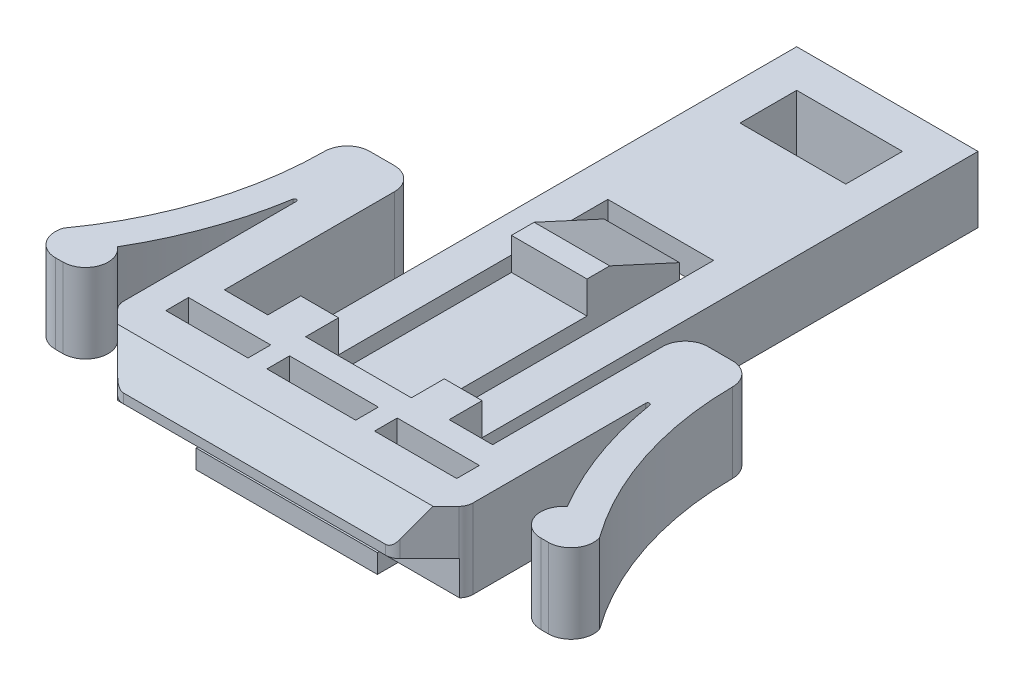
ISO-10303-21;
HEADER;
FILE_DESCRIPTION(('STEP AP214'),'2;1');
FILE_NAME('part.step','',(''),(''),'','','');
FILE_SCHEMA(('AUTOMOTIVE_DESIGN { 1 0 10303 214 1 1 1 1 }'));
ENDSEC;
DATA;
#1=APPLICATION_CONTEXT('core data for automotive mechanical design processes');
#2=APPLICATION_PROTOCOL_DEFINITION('international standard','automotive_design',2000,#1);
#3=PRODUCT_CONTEXT('',#1,'mechanical');
#4=PRODUCT('Part','Part','',(#3));
#5=PRODUCT_RELATED_PRODUCT_CATEGORY('part','',(#4));
#6=PRODUCT_DEFINITION_FORMATION('','',#4);
#7=PRODUCT_DEFINITION_CONTEXT('part definition',#1,'design');
#8=PRODUCT_DEFINITION('design','',#6,#7);
#9=PRODUCT_DEFINITION_SHAPE('','',#8);
#10=(LENGTH_UNIT() NAMED_UNIT(*) SI_UNIT(.MILLI.,.METRE.));
#11=(NAMED_UNIT(*) PLANE_ANGLE_UNIT() SI_UNIT($,.RADIAN.));
#12=(NAMED_UNIT(*) SI_UNIT($,.STERADIAN.) SOLID_ANGLE_UNIT());
#13=UNCERTAINTY_MEASURE_WITH_UNIT(LENGTH_MEASURE(1.E-05),#10,'distance_accuracy_value','');
#14=(GEOMETRIC_REPRESENTATION_CONTEXT(3) GLOBAL_UNCERTAINTY_ASSIGNED_CONTEXT((#13)) GLOBAL_UNIT_ASSIGNED_CONTEXT((#10,
#11,#12)) REPRESENTATION_CONTEXT('',''));
#15=CARTESIAN_POINT('',(0.,0.,0.));
#16=DIRECTION('',(0.,0.,1.));
#17=DIRECTION('',(1.,0.,0.));
#18=AXIS2_PLACEMENT_3D('',#15,#16,#17);
#19=CARTESIAN_POINT('',(0.,5.2,-0.449105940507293));
#20=DIRECTION('',(0.,1.,0.));
#21=DIRECTION('',(0.,0.,1.));
#22=AXIS2_PLACEMENT_3D('',#19,#20,#21);
#23=PLANE('',#22);
#24=DIRECTION('',(1.,0.,0.));
#25=VECTOR('',#24,1.);
#26=CARTESIAN_POINT('',(-2.,5.2,2.00178811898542));
#27=LINE('',#26,#25);
#28=CARTESIAN_POINT('',(2.,5.2,2.00178811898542));
#29=VERTEX_POINT('',#28);
#30=CARTESIAN_POINT('',(-2.,5.2,2.00178811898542));
#31=VERTEX_POINT('',#30);
#32=EDGE_CURVE('E1112',#29,#31,#27,.F.);
#33=ORIENTED_EDGE('',*,*,#32,.F.);
#34=DIRECTION('',(0.,0.,1.));
#35=VECTOR('',#34,1.);
#36=CARTESIAN_POINT('',(2.,5.2,-0.449105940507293));
#37=LINE('',#36,#35);
#38=CARTESIAN_POINT('',(2.,5.2,0.8));
#39=VERTEX_POINT('',#38);
#40=EDGE_CURVE('E1142',#29,#39,#37,.F.);
#41=ORIENTED_EDGE('',*,*,#40,.T.);
#42=DIRECTION('',(1.,0.,0.));
#43=VECTOR('',#42,1.);
#44=CARTESIAN_POINT('',(-1.,5.2,0.800000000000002));
#45=LINE('',#44,#43);
#46=CARTESIAN_POINT('',(-2.,5.2,0.800000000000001));
#47=VERTEX_POINT('',#46);
#48=EDGE_CURVE('E1121',#47,#39,#45,.T.);
#49=ORIENTED_EDGE('',*,*,#48,.F.);
#50=DIRECTION('',(0.,0.,1.));
#51=VECTOR('',#50,1.);
#52=CARTESIAN_POINT('',(-2.,5.2,-0.449105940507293));
#53=LINE('',#52,#51);
#54=EDGE_CURVE('E1144',#47,#31,#53,.T.);
#55=ORIENTED_EDGE('',*,*,#54,.T.);
#56=EDGE_LOOP('',(#33,#41,#49,#55));
#57=FACE_BOUND('',#56,.T.);
#58=ADVANCED_FACE('F17',(#57),#23,.T.);
#59=CARTESIAN_POINT('',(-1.,4.35,-1.05));
#60=DIRECTION('',(0.,0.908676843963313,-0.417500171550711));
#61=DIRECTION('',(0.,0.417500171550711,0.908676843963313));
#62=AXIS2_PLACEMENT_3D('',#59,#60,#61);
#63=PLANE('',#62);
#64=DIRECTION('',(0.,0.417500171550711,0.908676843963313));
#65=VECTOR('',#64,1.);
#66=CARTESIAN_POINT('',(2.,3.5,-2.9));
#67=LINE('',#66,#65);
#68=CARTESIAN_POINT('',(2.,3.5,-2.9));
#69=VERTEX_POINT('',#68);
#70=EDGE_CURVE('E1095',#69,#39,#67,.T.);
#71=ORIENTED_EDGE('',*,*,#70,.F.);
#72=DIRECTION('',(-1.,0.,0.));
#73=VECTOR('',#72,1.);
#74=CARTESIAN_POINT('',(-2.,3.5,-2.9));
#75=LINE('',#74,#73);
#76=CARTESIAN_POINT('',(-2.,3.5,-2.9));
#77=VERTEX_POINT('',#76);
#78=EDGE_CURVE('E1101',#77,#69,#75,.F.);
#79=ORIENTED_EDGE('',*,*,#78,.F.);
#80=DIRECTION('',(0.,-0.417500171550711,-0.908676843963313));
#81=VECTOR('',#80,1.);
#82=CARTESIAN_POINT('',(-2.,5.2,0.8));
#83=LINE('',#82,#81);
#84=EDGE_CURVE('E1109',#47,#77,#83,.T.);
#85=ORIENTED_EDGE('',*,*,#84,.F.);
#86=ORIENTED_EDGE('',*,*,#48,.T.);
#87=EDGE_LOOP('',(#71,#79,#85,#86));
#88=FACE_BOUND('',#87,.T.);
#89=ADVANCED_FACE('F1972',(#88),#63,.T.);
#90=CARTESIAN_POINT('',(4.80000000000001,1.,15.9));
#91=DIRECTION('',(0.,-1.,0.));
#92=DIRECTION('',(0.,0.,-1.));
#93=AXIS2_PLACEMENT_3D('',#90,#91,#92);
#94=PLANE('',#93);
#95=DIRECTION('',(0.,0.,-1.));
#96=VECTOR('',#95,1.);
#97=CARTESIAN_POINT('',(-4.79999999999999,1.,15.9));
#98=LINE('',#97,#96);
#99=CARTESIAN_POINT('',(-4.79999999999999,1.,15.9));
#100=VERTEX_POINT('',#99);
#101=CARTESIAN_POINT('',(-4.79999999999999,1.,15.8));
#102=VERTEX_POINT('',#101);
#103=EDGE_CURVE('E1115',#100,#102,#98,.T.);
#104=ORIENTED_EDGE('',*,*,#103,.F.);
#105=DIRECTION('',(1.,0.,0.));
#106=VECTOR('',#105,1.);
#107=CARTESIAN_POINT('',(-4.8,1.,15.9));
#108=LINE('',#107,#106);
#109=CARTESIAN_POINT('',(4.8,1.,15.9));
#110=VERTEX_POINT('',#109);
#111=EDGE_CURVE('E491',#110,#100,#108,.F.);
#112=ORIENTED_EDGE('',*,*,#111,.F.);
#113=DIRECTION('',(0.,0.,-1.));
#114=VECTOR('',#113,1.);
#115=CARTESIAN_POINT('',(4.8,1.,15.9));
#116=LINE('',#115,#114);
#117=CARTESIAN_POINT('',(4.8,1.,15.8));
#118=VERTEX_POINT('',#117);
#119=EDGE_CURVE('E1117',#118,#110,#116,.F.);
#120=ORIENTED_EDGE('',*,*,#119,.F.);
#121=DIRECTION('',(1.,0.,0.));
#122=VECTOR('',#121,1.);
#123=CARTESIAN_POINT('',(-9.25,1.,15.8));
#124=LINE('',#123,#122);
#125=EDGE_CURVE('E1035',#102,#118,#124,.T.);
#126=ORIENTED_EDGE('',*,*,#125,.F.);
#127=EDGE_LOOP('',(#104,#112,#120,#126));
#128=FACE_BOUND('',#127,.T.);
#129=ADVANCED_FACE('F1963',(#128),#94,.F.);
#130=CARTESIAN_POINT('',(-2.,3.5,2.00178811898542));
#131=DIRECTION('',(0.,0.,1.));
#132=DIRECTION('',(1.,0.,0.));
#133=AXIS2_PLACEMENT_3D('',#130,#131,#132);
#134=PLANE('',#133);
#135=ORIENTED_EDGE('',*,*,#32,.T.);
#136=DIRECTION('',(0.,1.,0.));
#137=VECTOR('',#136,1.);
#138=CARTESIAN_POINT('',(-2.,3.5,2.00178811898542));
#139=LINE('',#138,#137);
#140=CARTESIAN_POINT('',(-2.,3.5,2.00178811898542));
#141=VERTEX_POINT('',#140);
#142=EDGE_CURVE('E1104',#141,#31,#139,.T.);
#143=ORIENTED_EDGE('',*,*,#142,.F.);
#144=DIRECTION('',(1.,0.,0.));
#145=VECTOR('',#144,1.);
#146=CARTESIAN_POINT('',(0.,3.5,2.00178811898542));
#147=LINE('',#146,#145);
#148=CARTESIAN_POINT('',(2.,3.5,2.00178811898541));
#149=VERTEX_POINT('',#148);
#150=EDGE_CURVE('E954',#141,#149,#147,.T.);
#151=ORIENTED_EDGE('',*,*,#150,.T.);
#152=DIRECTION('',(0.,1.,0.));
#153=VECTOR('',#152,1.);
#154=CARTESIAN_POINT('',(2.,3.5,2.00178811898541));
#155=LINE('',#154,#153);
#156=EDGE_CURVE('E1093',#29,#149,#155,.F.);
#157=ORIENTED_EDGE('',*,*,#156,.F.);
#158=EDGE_LOOP('',(#135,#143,#151,#157));
#159=FACE_BOUND('',#158,.T.);
#160=ADVANCED_FACE('F1954',(#159),#134,.T.);
#161=CARTESIAN_POINT('',(-2.,3.5,12.1));
#162=DIRECTION('',(-1.,0.,0.));
#163=DIRECTION('',(0.,0.,1.));
#164=AXIS2_PLACEMENT_3D('',#161,#162,#163);
#165=PLANE('',#164);
#166=ORIENTED_EDGE('',*,*,#142,.T.);
#167=ORIENTED_EDGE('',*,*,#54,.F.);
#168=ORIENTED_EDGE('',*,*,#84,.T.);
#169=DIRECTION('',(0.,1.,0.));
#170=VECTOR('',#169,1.);
#171=CARTESIAN_POINT('',(-2.,3.5,-2.9));
#172=LINE('',#171,#170);
#173=CARTESIAN_POINT('',(-2.,2.,-2.9));
#174=VERTEX_POINT('',#173);
#175=EDGE_CURVE('E1098',#174,#77,#172,.T.);
#176=ORIENTED_EDGE('',*,*,#175,.F.);
#177=DIRECTION('',(0.,0.,-1.));
#178=VECTOR('',#177,1.);
#179=CARTESIAN_POINT('',(-2.,2.,4.6));
#180=LINE('',#179,#178);
#181=CARTESIAN_POINT('',(-2.,2.,12.1));
#182=VERTEX_POINT('',#181);
#183=EDGE_CURVE('E951',#182,#174,#180,.T.);
#184=ORIENTED_EDGE('',*,*,#183,.F.);
#185=DIRECTION('',(0.,1.,0.));
#186=VECTOR('',#185,1.);
#187=CARTESIAN_POINT('',(-2.,3.5,12.1));
#188=LINE('',#187,#186);
#189=CARTESIAN_POINT('',(-2.,3.5,12.1));
#190=VERTEX_POINT('',#189);
#191=EDGE_CURVE('E1107',#182,#190,#188,.T.);
#192=ORIENTED_EDGE('',*,*,#191,.T.);
#193=DIRECTION('',(0.,0.,-1.));
#194=VECTOR('',#193,1.);
#195=CARTESIAN_POINT('',(-2.,3.5,4.6));
#196=LINE('',#195,#194);
#197=EDGE_CURVE('E957',#190,#141,#196,.T.);
#198=ORIENTED_EDGE('',*,*,#197,.T.);
#199=EDGE_LOOP('',(#166,#167,#168,#176,#184,#192,#198));
#200=FACE_BOUND('',#199,.T.);
#201=ADVANCED_FACE('F1945',(#200),#165,.T.);
#202=CARTESIAN_POINT('',(-2.,3.5,-2.9));
#203=DIRECTION('',(0.,0.,-1.));
#204=DIRECTION('',(-1.,0.,0.));
#205=AXIS2_PLACEMENT_3D('',#202,#203,#204);
#206=PLANE('',#205);
#207=DIRECTION('',(1.,0.,0.));
#208=VECTOR('',#207,1.);
#209=CARTESIAN_POINT('',(0.,2.,-2.9));
#210=LINE('',#209,#208);
#211=CARTESIAN_POINT('',(2.,2.,-2.9));
#212=VERTEX_POINT('',#211);
#213=EDGE_CURVE('E948',#174,#212,#210,.T.);
#214=ORIENTED_EDGE('',*,*,#213,.F.);
#215=ORIENTED_EDGE('',*,*,#175,.T.);
#216=ORIENTED_EDGE('',*,*,#78,.T.);
#217=DIRECTION('',(0.,1.,0.));
#218=VECTOR('',#217,1.);
#219=CARTESIAN_POINT('',(2.,3.5,-2.9));
#220=LINE('',#219,#218);
#221=EDGE_CURVE('E1083',#212,#69,#220,.T.);
#222=ORIENTED_EDGE('',*,*,#221,.F.);
#223=EDGE_LOOP('',(#214,#215,#216,#222));
#224=FACE_BOUND('',#223,.T.);
#225=ADVANCED_FACE('F1936',(#224),#206,.T.);
#226=CARTESIAN_POINT('',(2.,3.5,-2.9));
#227=DIRECTION('',(1.,0.,0.));
#228=DIRECTION('',(0.,0.,-1.));
#229=AXIS2_PLACEMENT_3D('',#226,#227,#228);
#230=PLANE('',#229);
#231=DIRECTION('',(0.,0.,-1.));
#232=VECTOR('',#231,1.);
#233=CARTESIAN_POINT('',(2.,2.,4.6));
#234=LINE('',#233,#232);
#235=CARTESIAN_POINT('',(2.,2.,12.1));
#236=VERTEX_POINT('',#235);
#237=EDGE_CURVE('E944',#212,#236,#234,.F.);
#238=ORIENTED_EDGE('',*,*,#237,.F.);
#239=ORIENTED_EDGE('',*,*,#221,.T.);
#240=ORIENTED_EDGE('',*,*,#70,.T.);
#241=ORIENTED_EDGE('',*,*,#40,.F.);
#242=ORIENTED_EDGE('',*,*,#156,.T.);
#243=DIRECTION('',(0.,0.,-1.));
#244=VECTOR('',#243,1.);
#245=CARTESIAN_POINT('',(2.,3.5,4.6));
#246=LINE('',#245,#244);
#247=CARTESIAN_POINT('',(2.,3.5,12.1));
#248=VERTEX_POINT('',#247);
#249=EDGE_CURVE('E960',#149,#248,#246,.F.);
#250=ORIENTED_EDGE('',*,*,#249,.T.);
#251=DIRECTION('',(0.,1.,0.));
#252=VECTOR('',#251,1.);
#253=CARTESIAN_POINT('',(2.,3.5,12.1));
#254=LINE('',#253,#252);
#255=EDGE_CURVE('E1091',#248,#236,#254,.F.);
#256=ORIENTED_EDGE('',*,*,#255,.T.);
#257=EDGE_LOOP('',(#238,#239,#240,#241,#242,#250,#256));
#258=FACE_BOUND('',#257,.T.);
#259=ADVANCED_FACE('F1927',(#258),#230,.T.);
#260=CARTESIAN_POINT('',(2.8,3.5,-3.9));
#261=DIRECTION('',(0.,0.,1.));
#262=DIRECTION('',(1.,0.,0.));
#263=AXIS2_PLACEMENT_3D('',#260,#261,#262);
#264=PLANE('',#263);
#265=DIRECTION('',(1.,0.,0.));
#266=VECTOR('',#265,1.);
#267=CARTESIAN_POINT('',(0.,2.,-3.9));
#268=LINE('',#267,#266);
#269=CARTESIAN_POINT('',(2.8,2.,-3.9));
#270=VERTEX_POINT('',#269);
#271=CARTESIAN_POINT('',(-2.8,2.,-3.9));
#272=VERTEX_POINT('',#271);
#273=EDGE_CURVE('E912',#270,#272,#268,.F.);
#274=ORIENTED_EDGE('',*,*,#273,.F.);
#275=DIRECTION('',(0.,1.,0.));
#276=VECTOR('',#275,1.);
#277=CARTESIAN_POINT('',(2.8,3.5,-3.9));
#278=LINE('',#277,#276);
#279=CARTESIAN_POINT('',(2.8,3.5,-3.9));
#280=VERTEX_POINT('',#279);
#281=EDGE_CURVE('E1078',#270,#280,#278,.T.);
#282=ORIENTED_EDGE('',*,*,#281,.T.);
#283=DIRECTION('',(1.,0.,0.));
#284=VECTOR('',#283,1.);
#285=CARTESIAN_POINT('',(0.,3.5,-3.9));
#286=LINE('',#285,#284);
#287=CARTESIAN_POINT('',(-2.8,3.5,-3.9));
#288=VERTEX_POINT('',#287);
#289=EDGE_CURVE('E908',#288,#280,#286,.T.);
#290=ORIENTED_EDGE('',*,*,#289,.F.);
#291=DIRECTION('',(0.,1.,0.));
#292=VECTOR('',#291,1.);
#293=CARTESIAN_POINT('',(-2.8,3.5,-3.9));
#294=LINE('',#293,#292);
#295=EDGE_CURVE('E1081',#288,#272,#294,.F.);
#296=ORIENTED_EDGE('',*,*,#295,.T.);
#297=EDGE_LOOP('',(#274,#282,#290,#296));
#298=FACE_BOUND('',#297,.T.);
#299=ADVANCED_FACE('F1918',(#298),#264,.T.);
#300=CARTESIAN_POINT('',(-2.8,3.5,-10.9));
#301=DIRECTION('',(0.,0.,-1.));
#302=DIRECTION('',(-1.,0.,0.));
#303=AXIS2_PLACEMENT_3D('',#300,#301,#302);
#304=PLANE('',#303);
#305=DIRECTION('',(1.,0.,0.));
#306=VECTOR('',#305,1.);
#307=CARTESIAN_POINT('',(0.,2.,-10.9));
#308=LINE('',#307,#306);
#309=CARTESIAN_POINT('',(-2.8,2.,-10.9));
#310=VERTEX_POINT('',#309);
#311=CARTESIAN_POINT('',(2.8,2.,-10.9));
#312=VERTEX_POINT('',#311);
#313=EDGE_CURVE('E947',#310,#312,#308,.T.);
#314=ORIENTED_EDGE('',*,*,#313,.F.);
#315=DIRECTION('',(0.,1.,0.));
#316=VECTOR('',#315,1.);
#317=CARTESIAN_POINT('',(-2.8,3.5,-10.9));
#318=LINE('',#317,#316);
#319=CARTESIAN_POINT('',(-2.8,3.5,-10.9));
#320=VERTEX_POINT('',#319);
#321=EDGE_CURVE('E1068',#310,#320,#318,.T.);
#322=ORIENTED_EDGE('',*,*,#321,.T.);
#323=DIRECTION('',(1.,0.,0.));
#324=VECTOR('',#323,1.);
#325=CARTESIAN_POINT('',(0.,3.5,-10.9));
#326=LINE('',#325,#324);
#327=CARTESIAN_POINT('',(2.8,3.5,-10.9));
#328=VERTEX_POINT('',#327);
#329=EDGE_CURVE('E911',#328,#320,#326,.F.);
#330=ORIENTED_EDGE('',*,*,#329,.F.);
#331=DIRECTION('',(0.,1.,0.));
#332=VECTOR('',#331,1.);
#333=CARTESIAN_POINT('',(2.8,3.5,-10.9));
#334=LINE('',#333,#332);
#335=EDGE_CURVE('E1074',#328,#312,#334,.F.);
#336=ORIENTED_EDGE('',*,*,#335,.T.);
#337=EDGE_LOOP('',(#314,#322,#330,#336));
#338=FACE_BOUND('',#337,.T.);
#339=ADVANCED_FACE('F1910',(#338),#304,.T.);
#340=CARTESIAN_POINT('',(-9.25,2.8,15.8));
#341=DIRECTION('',(0.,-1.,0.));
#342=DIRECTION('',(1.,0.,0.));
#343=AXIS2_PLACEMENT_3D('',#340,#341,#342);
#344=PLANE('',#343);
#345=CARTESIAN_POINT('',(-8.5,2.8,15.2893398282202));
#346=DIRECTION('',(0.,-1.,0.));
#347=DIRECTION('',(0.,0.,-1.));
#348=AXIS2_PLACEMENT_3D('',#345,#346,#347);
#349=CIRCLE('',#348,0.75);
#350=CARTESIAN_POINT('',(-9.04929608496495,2.8,15.8));
#351=VERTEX_POINT('',#350);
#352=CARTESIAN_POINT('',(-9.0303300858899,2.8,15.8196699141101));
#353=VERTEX_POINT('',#352);
#354=EDGE_CURVE('E873',#351,#353,#349,.F.);
#355=ORIENTED_EDGE('',*,*,#354,.F.);
#356=DIRECTION('',(1.,0.,0.));
#357=VECTOR('',#356,1.);
#358=CARTESIAN_POINT('',(-9.25,2.8,15.8));
#359=LINE('',#358,#357);
#360=CARTESIAN_POINT('',(9.04929608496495,2.8,15.8));
#361=VERTEX_POINT('',#360);
#362=EDGE_CURVE('E1038',#361,#351,#359,.F.);
#363=ORIENTED_EDGE('',*,*,#362,.F.);
#364=CARTESIAN_POINT('',(8.5,2.8,15.2893398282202));
#365=DIRECTION('',(0.,1.,0.));
#366=DIRECTION('',(0.,0.,1.));
#367=AXIS2_PLACEMENT_3D('',#364,#365,#366);
#368=CIRCLE('',#367,0.75);
#369=CARTESIAN_POINT('',(9.0303300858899,2.8,15.8196699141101));
#370=VERTEX_POINT('',#369);
#371=EDGE_CURVE('E490',#370,#361,#368,.T.);
#372=ORIENTED_EDGE('',*,*,#371,.F.);
#373=DIRECTION('',(0.707106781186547,0.,-0.707106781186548));
#374=VECTOR('',#373,1.);
#375=CARTESIAN_POINT('',(8.25,2.8,16.6));
#376=LINE('',#375,#374);
#377=CARTESIAN_POINT('',(7.46966991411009,2.8,17.3803300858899));
#378=VERTEX_POINT('',#377);
#379=EDGE_CURVE('E853',#378,#370,#376,.T.);
#380=ORIENTED_EDGE('',*,*,#379,.F.);
#381=CARTESIAN_POINT('',(6.93933982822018,2.8,16.85));
#382=DIRECTION('',(0.,-1.,0.));
#383=DIRECTION('',(0.,0.,-1.));
#384=AXIS2_PLACEMENT_3D('',#381,#382,#383);
#385=CIRCLE('',#384,0.75);
#386=CARTESIAN_POINT('',(6.93933982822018,2.8,17.6));
#387=VERTEX_POINT('',#386);
#388=EDGE_CURVE('E1065',#387,#378,#385,.F.);
#389=ORIENTED_EDGE('',*,*,#388,.F.);
#390=DIRECTION('',(1.,0.,0.));
#391=VECTOR('',#390,1.);
#392=CARTESIAN_POINT('',(0.,2.8,17.6));
#393=LINE('',#392,#391);
#394=CARTESIAN_POINT('',(-6.93933982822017,2.8,17.6));
#395=VERTEX_POINT('',#394);
#396=EDGE_CURVE('E840',#395,#387,#393,.T.);
#397=ORIENTED_EDGE('',*,*,#396,.F.);
#398=CARTESIAN_POINT('',(-6.93933982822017,2.8,16.85));
#399=DIRECTION('',(0.,1.,0.));
#400=DIRECTION('',(0.,0.,1.));
#401=AXIS2_PLACEMENT_3D('',#398,#399,#400);
#402=CIRCLE('',#401,0.75);
#403=CARTESIAN_POINT('',(-7.46966991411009,2.8,17.3803300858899));
#404=VERTEX_POINT('',#403);
#405=EDGE_CURVE('E844',#404,#395,#402,.T.);
#406=ORIENTED_EDGE('',*,*,#405,.F.);
#407=DIRECTION('',(0.707106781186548,0.,0.707106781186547));
#408=VECTOR('',#407,1.);
#409=CARTESIAN_POINT('',(-8.25,2.8,16.6));
#410=LINE('',#409,#408);
#411=EDGE_CURVE('E848',#353,#404,#410,.T.);
#412=ORIENTED_EDGE('',*,*,#411,.F.);
#413=EDGE_LOOP('',(#355,#363,#372,#380,#389,#397,#406,#412));
#414=FACE_BOUND('',#413,.T.);
#415=ADVANCED_FACE('F1228',(#414),#344,.T.);
#416=CARTESIAN_POINT('',(-9.25,1.,15.8));
#417=DIRECTION('',(0.,0.,1.));
#418=DIRECTION('',(1.,0.,0.));
#419=AXIS2_PLACEMENT_3D('',#416,#417,#418);
#420=PLANE('',#419);
#421=ORIENTED_EDGE('',*,*,#125,.T.);
#422=DIRECTION('',(1.,0.,0.));
#423=VECTOR('',#422,1.);
#424=CARTESIAN_POINT('',(-12.2691469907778,1.,15.8));
#425=LINE('',#424,#423);
#426=CARTESIAN_POINT('',(9.04929608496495,1.,15.8));
#427=VERTEX_POINT('',#426);
#428=EDGE_CURVE('E820',#118,#427,#425,.T.);
#429=ORIENTED_EDGE('',*,*,#428,.T.);
#430=DIRECTION('',(0.,1.,0.));
#431=VECTOR('',#430,1.);
#432=CARTESIAN_POINT('',(9.04929608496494,1.75,15.8));
#433=LINE('',#432,#431);
#434=EDGE_CURVE('E1044',#361,#427,#433,.F.);
#435=ORIENTED_EDGE('',*,*,#434,.F.);
#436=ORIENTED_EDGE('',*,*,#362,.T.);
#437=DIRECTION('',(0.,-1.,0.));
#438=VECTOR('',#437,1.);
#439=CARTESIAN_POINT('',(-9.04929608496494,1.75,15.8));
#440=LINE('',#439,#438);
#441=CARTESIAN_POINT('',(-9.04929608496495,1.,15.8));
#442=VERTEX_POINT('',#441);
#443=EDGE_CURVE('E1030',#442,#351,#440,.F.);
#444=ORIENTED_EDGE('',*,*,#443,.F.);
#445=DIRECTION('',(1.,0.,0.));
#446=VECTOR('',#445,1.);
#447=CARTESIAN_POINT('',(-12.2691469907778,1.,15.8));
#448=LINE('',#447,#446);
#449=EDGE_CURVE('E814',#442,#102,#448,.T.);
#450=ORIENTED_EDGE('',*,*,#449,.T.);
#451=EDGE_LOOP('',(#421,#429,#435,#436,#444,#450));
#452=FACE_BOUND('',#451,.T.);
#453=ADVANCED_FACE('F1231',(#452),#420,.T.);
#454=CARTESIAN_POINT('',(-4.8,0.,15.9));
#455=DIRECTION('',(0.,0.,1.));
#456=DIRECTION('',(1.,0.,0.));
#457=AXIS2_PLACEMENT_3D('',#454,#455,#456);
#458=PLANE('',#457);
#459=DIRECTION('',(1.,0.,0.));
#460=VECTOR('',#459,1.);
#461=CARTESIAN_POINT('',(0.,0.,15.9));
#462=LINE('',#461,#460);
#463=CARTESIAN_POINT('',(4.8,0.,15.9));
#464=VERTEX_POINT('',#463);
#465=CARTESIAN_POINT('',(-4.79999999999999,0.,15.9));
#466=VERTEX_POINT('',#465);
#467=EDGE_CURVE('E789',#464,#466,#462,.F.);
#468=ORIENTED_EDGE('',*,*,#467,.F.);
#469=DIRECTION('',(0.,1.,0.));
#470=VECTOR('',#469,1.);
#471=CARTESIAN_POINT('',(4.8,0.,15.9));
#472=LINE('',#471,#470);
#473=EDGE_CURVE('E836',#110,#464,#472,.F.);
#474=ORIENTED_EDGE('',*,*,#473,.F.);
#475=ORIENTED_EDGE('',*,*,#111,.T.);
#476=DIRECTION('',(0.,1.,0.));
#477=VECTOR('',#476,1.);
#478=CARTESIAN_POINT('',(-4.79999999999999,0.,15.9));
#479=LINE('',#478,#477);
#480=EDGE_CURVE('E817',#466,#100,#479,.T.);
#481=ORIENTED_EDGE('',*,*,#480,.F.);
#482=EDGE_LOOP('',(#468,#474,#475,#481));
#483=FACE_BOUND('',#482,.T.);
#484=ADVANCED_FACE('F1887',(#483),#458,.T.);
#485=CARTESIAN_POINT('',(8.5,1.75,15.2893398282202));
#486=DIRECTION('',(0.,1.,0.));
#487=DIRECTION('',(0.,0.,1.));
#488=AXIS2_PLACEMENT_3D('',#485,#486,#487);
#489=CYLINDRICAL_SURFACE('',#488,0.75);
#490=CARTESIAN_POINT('',(8.5,1.,15.2893398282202));
#491=DIRECTION('',(0.,1.,0.));
#492=DIRECTION('',(0.,0.,1.));
#493=AXIS2_PLACEMENT_3D('',#490,#491,#492);
#494=CIRCLE('',#493,0.75);
#495=CARTESIAN_POINT('',(9.25,1.,15.2893398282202));
#496=VERTEX_POINT('',#495);
#497=EDGE_CURVE('E497',#427,#496,#494,.T.);
#498=ORIENTED_EDGE('',*,*,#497,.T.);
#499=DIRECTION('',(0.,1.,0.));
#500=VECTOR('',#499,1.);
#501=CARTESIAN_POINT('',(9.25,1.,15.2893398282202));
#502=LINE('',#501,#500);
#503=CARTESIAN_POINT('',(9.24999999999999,5.2,15.2893398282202));
#504=VERTEX_POINT('',#503);
#505=EDGE_CURVE('E493',#504,#496,#502,.F.);
#506=ORIENTED_EDGE('',*,*,#505,.F.);
#507=CARTESIAN_POINT('',(8.5,5.2,15.2893398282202));
#508=DIRECTION('',(0.,1.,0.));
#509=DIRECTION('',(0.,0.,1.));
#510=AXIS2_PLACEMENT_3D('',#507,#508,#509);
#511=CIRCLE('',#510,0.75);
#512=CARTESIAN_POINT('',(9.0303300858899,5.2,15.8196699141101));
#513=VERTEX_POINT('',#512);
#514=EDGE_CURVE('E20',#504,#513,#511,.F.);
#515=ORIENTED_EDGE('',*,*,#514,.T.);
#516=DIRECTION('',(0.,1.,0.));
#517=VECTOR('',#516,1.);
#518=CARTESIAN_POINT('',(9.0303300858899,2.5,15.8196699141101));
#519=LINE('',#518,#517);
#520=EDGE_CURVE('E866',#370,#513,#519,.T.);
#521=ORIENTED_EDGE('',*,*,#520,.F.);
#522=ORIENTED_EDGE('',*,*,#371,.T.);
#523=ORIENTED_EDGE('',*,*,#434,.T.);
#524=EDGE_LOOP('',(#498,#506,#515,#521,#522,#523));
#525=FACE_BOUND('',#524,.T.);
#526=ADVANCED_FACE('F494',(#525),#489,.T.);
#527=CARTESIAN_POINT('',(9.35,1.,6.14000000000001));
#528=DIRECTION('',(0.,1.,0.));
#529=DIRECTION('',(0.,0.,1.));
#530=AXIS2_PLACEMENT_3D('',#527,#528,#529);
#531=CYLINDRICAL_SURFACE('',#530,0.100238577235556);
#532=DIRECTION('',(0.,1.,0.));
#533=VECTOR('',#532,1.);
#534=CARTESIAN_POINT('',(9.44896531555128,1.,6.12407396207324));
#535=LINE('',#534,#533);
#536=CARTESIAN_POINT('',(9.44896531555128,5.2,6.12407396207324));
#537=VERTEX_POINT('',#536);
#538=CARTESIAN_POINT('',(9.44896531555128,1.,6.12407396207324));
#539=VERTEX_POINT('',#538);
#540=EDGE_CURVE('E771',#537,#539,#535,.F.);
#541=ORIENTED_EDGE('',*,*,#540,.F.);
#542=CARTESIAN_POINT('',(9.35,5.2,6.14000000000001));
#543=DIRECTION('',(0.,1.,0.));
#544=DIRECTION('',(0.,0.,1.));
#545=AXIS2_PLACEMENT_3D('',#542,#543,#544);
#546=CIRCLE('',#545,0.100238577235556);
#547=CARTESIAN_POINT('',(9.24999999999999,5.2,6.14691175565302));
#548=VERTEX_POINT('',#547);
#549=EDGE_CURVE('E1021',#548,#537,#546,.F.);
#550=ORIENTED_EDGE('',*,*,#549,.F.);
#551=DIRECTION('',(0.,1.,0.));
#552=VECTOR('',#551,1.);
#553=CARTESIAN_POINT('',(9.25,1.,6.14691175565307));
#554=LINE('',#553,#552);
#555=CARTESIAN_POINT('',(9.25,1.,6.14691175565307));
#556=VERTEX_POINT('',#555);
#557=EDGE_CURVE('E507',#556,#548,#554,.T.);
#558=ORIENTED_EDGE('',*,*,#557,.F.);
#559=CARTESIAN_POINT('',(9.35,1.,6.14000000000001));
#560=DIRECTION('',(0.,1.,0.));
#561=DIRECTION('',(0.,0.,1.));
#562=AXIS2_PLACEMENT_3D('',#559,#560,#561);
#563=CIRCLE('',#562,0.100238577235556);
#564=EDGE_CURVE('E831',#556,#539,#563,.F.);
#565=ORIENTED_EDGE('',*,*,#564,.T.);
#566=EDGE_LOOP('',(#541,#550,#558,#565));
#567=FACE_BOUND('',#566,.T.);
#568=ADVANCED_FACE('F1241',(#567),#531,.F.);
#569=CARTESIAN_POINT('',(12.65,1.,15.1));
#570=DIRECTION('',(0.,0.,1.));
#571=DIRECTION('',(1.,0.,0.));
#572=AXIS2_PLACEMENT_3D('',#569,#570,#571);
#573=PLANE('',#572);
#574=DIRECTION('',(1.,0.,0.));
#575=VECTOR('',#574,1.);
#576=CARTESIAN_POINT('',(12.65,5.2,15.1));
#577=LINE('',#576,#575);
#578=CARTESIAN_POINT('',(13.05,5.2,15.1));
#579=VERTEX_POINT('',#578);
#580=CARTESIAN_POINT('',(12.65,5.2,15.1));
#581=VERTEX_POINT('',#580);
#582=EDGE_CURVE('E1019',#579,#581,#577,.F.);
#583=ORIENTED_EDGE('',*,*,#582,.T.);
#584=DIRECTION('',(0.,1.,0.));
#585=VECTOR('',#584,1.);
#586=CARTESIAN_POINT('',(12.65,1.,15.1));
#587=LINE('',#586,#585);
#588=CARTESIAN_POINT('',(12.65,1.,15.1));
#589=VERTEX_POINT('',#588);
#590=EDGE_CURVE('E764',#589,#581,#587,.T.);
#591=ORIENTED_EDGE('',*,*,#590,.F.);
#592=DIRECTION('',(1.,0.,0.));
#593=VECTOR('',#592,1.);
#594=CARTESIAN_POINT('',(-12.2691469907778,1.,15.1));
#595=LINE('',#594,#593);
#596=CARTESIAN_POINT('',(13.05,1.,15.1));
#597=VERTEX_POINT('',#596);
#598=EDGE_CURVE('E829',#589,#597,#595,.T.);
#599=ORIENTED_EDGE('',*,*,#598,.T.);
#600=DIRECTION('',(0.,1.,0.));
#601=VECTOR('',#600,1.);
#602=CARTESIAN_POINT('',(13.05,1.,15.1));
#603=LINE('',#602,#601);
#604=EDGE_CURVE('E760',#579,#597,#603,.F.);
#605=ORIENTED_EDGE('',*,*,#604,.F.);
#606=EDGE_LOOP('',(#583,#591,#599,#605));
#607=FACE_BOUND('',#606,.T.);
#608=ADVANCED_FACE('F1250',(#607),#573,.T.);
#609=CARTESIAN_POINT('',(9.59999999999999,1.,1.90000000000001));
#610=DIRECTION('',(0.,0.,-1.));
#611=DIRECTION('',(-1.,0.,0.));
#612=AXIS2_PLACEMENT_3D('',#609,#610,#611);
#613=PLANE('',#612);
#614=DIRECTION('',(-1.,0.,0.));
#615=VECTOR('',#614,1.);
#616=CARTESIAN_POINT('',(9.59999999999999,5.2,1.90000000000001));
#617=LINE('',#616,#615);
#618=CARTESIAN_POINT('',(8.29999999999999,5.2,1.90000000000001));
#619=VERTEX_POINT('',#618);
#620=CARTESIAN_POINT('',(9.59999999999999,5.2,1.90000000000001));
#621=VERTEX_POINT('',#620);
#622=EDGE_CURVE('E963',#619,#621,#617,.F.);
#623=ORIENTED_EDGE('',*,*,#622,.T.);
#624=DIRECTION('',(0.,1.,0.));
#625=VECTOR('',#624,1.);
#626=CARTESIAN_POINT('',(9.59999999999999,1.,1.9));
#627=LINE('',#626,#625);
#628=CARTESIAN_POINT('',(9.59999999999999,1.,1.9));
#629=VERTEX_POINT('',#628);
#630=EDGE_CURVE('E750',#629,#621,#627,.T.);
#631=ORIENTED_EDGE('',*,*,#630,.F.);
#632=DIRECTION('',(1.,0.,0.));
#633=VECTOR('',#632,1.);
#634=CARTESIAN_POINT('',(-12.2691469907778,1.,1.90000000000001));
#635=LINE('',#634,#633);
#636=CARTESIAN_POINT('',(8.29999999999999,1.,1.90000000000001));
#637=VERTEX_POINT('',#636);
#638=EDGE_CURVE('E827',#629,#637,#635,.F.);
#639=ORIENTED_EDGE('',*,*,#638,.T.);
#640=DIRECTION('',(0.,1.,0.));
#641=VECTOR('',#640,1.);
#642=CARTESIAN_POINT('',(8.29999999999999,1.,1.90000000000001));
#643=LINE('',#642,#641);
#644=EDGE_CURVE('E746',#619,#637,#643,.F.);
#645=ORIENTED_EDGE('',*,*,#644,.F.);
#646=EDGE_LOOP('',(#623,#631,#639,#645));
#647=FACE_BOUND('',#646,.T.);
#648=ADVANCED_FACE('F1269',(#647),#613,.T.);
#649=CARTESIAN_POINT('',(0.,3.5,4.6));
#650=DIRECTION('',(0.,-1.,0.));
#651=DIRECTION('',(0.,0.,-1.));
#652=AXIS2_PLACEMENT_3D('',#649,#650,#651);
#653=PLANE('',#652);
#654=ORIENTED_EDGE('',*,*,#197,.F.);
#655=DIRECTION('',(1.,0.,0.));
#656=VECTOR('',#655,1.);
#657=CARTESIAN_POINT('',(-2.8,3.5,12.1));
#658=LINE('',#657,#656);
#659=EDGE_CURVE('E689',#190,#248,#658,.T.);
#660=ORIENTED_EDGE('',*,*,#659,.T.);
#661=ORIENTED_EDGE('',*,*,#249,.F.);
#662=ORIENTED_EDGE('',*,*,#150,.F.);
#663=EDGE_LOOP('',(#654,#660,#661,#662));
#664=FACE_BOUND('',#663,.T.);
#665=ADVANCED_FACE('F1849',(#664),#653,.F.);
#666=CARTESIAN_POINT('',(0.,2.,4.6));
#667=DIRECTION('',(0.,-1.,0.));
#668=DIRECTION('',(0.,0.,-1.));
#669=AXIS2_PLACEMENT_3D('',#666,#667,#668);
#670=PLANE('',#669);
#671=ORIENTED_EDGE('',*,*,#213,.T.);
#672=ORIENTED_EDGE('',*,*,#237,.T.);
#673=DIRECTION('',(1.,0.,0.));
#674=VECTOR('',#673,1.);
#675=CARTESIAN_POINT('',(-2.8,2.,12.1));
#676=LINE('',#675,#674);
#677=EDGE_CURVE('E685',#236,#182,#676,.F.);
#678=ORIENTED_EDGE('',*,*,#677,.T.);
#679=ORIENTED_EDGE('',*,*,#183,.T.);
#680=EDGE_LOOP('',(#671,#672,#678,#679));
#681=FACE_BOUND('',#680,.T.);
#682=ADVANCED_FACE('F1840',(#681),#670,.T.);
#683=CARTESIAN_POINT('',(0.,2.,-7.4));
#684=DIRECTION('',(0.,-1.,0.));
#685=DIRECTION('',(0.,0.,-1.));
#686=AXIS2_PLACEMENT_3D('',#683,#684,#685);
#687=PLANE('',#686);
#688=DIRECTION('',(0.,0.,-1.));
#689=VECTOR('',#688,1.);
#690=CARTESIAN_POINT('',(2.8,2.,12.1));
#691=LINE('',#690,#689);
#692=EDGE_CURVE('E974',#312,#270,#691,.F.);
#693=ORIENTED_EDGE('',*,*,#692,.T.);
#694=ORIENTED_EDGE('',*,*,#273,.T.);
#695=DIRECTION('',(0.,0.,1.));
#696=VECTOR('',#695,1.);
#697=CARTESIAN_POINT('',(-2.8,2.,-13.9));
#698=LINE('',#697,#696);
#699=EDGE_CURVE('E688',#272,#310,#698,.F.);
#700=ORIENTED_EDGE('',*,*,#699,.T.);
#701=ORIENTED_EDGE('',*,*,#313,.T.);
#702=EDGE_LOOP('',(#693,#694,#700,#701));
#703=FACE_BOUND('',#702,.T.);
#704=ADVANCED_FACE('F1831',(#703),#687,.T.);
#705=CARTESIAN_POINT('',(2.8,0.,-13.9));
#706=DIRECTION('',(0.,0.,-1.));
#707=DIRECTION('',(-1.,0.,0.));
#708=AXIS2_PLACEMENT_3D('',#705,#706,#707);
#709=PLANE('',#708);
#710=DIRECTION('',(0.,1.,0.));
#711=VECTOR('',#710,1.);
#712=CARTESIAN_POINT('',(2.79999999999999,0.,-13.9));
#713=LINE('',#712,#711);
#714=CARTESIAN_POINT('',(2.8,0.,-13.9));
#715=VERTEX_POINT('',#714);
#716=CARTESIAN_POINT('',(2.8,3.5,-13.9));
#717=VERTEX_POINT('',#716);
#718=EDGE_CURVE('E966',#715,#717,#713,.T.);
#719=ORIENTED_EDGE('',*,*,#718,.T.);
#720=DIRECTION('',(1.,0.,0.));
#721=VECTOR('',#720,1.);
#722=CARTESIAN_POINT('',(0.,3.5,-13.9));
#723=LINE('',#722,#721);
#724=CARTESIAN_POINT('',(-2.8,3.5,-13.9));
#725=VERTEX_POINT('',#724);
#726=EDGE_CURVE('E935',#725,#717,#723,.T.);
#727=ORIENTED_EDGE('',*,*,#726,.F.);
#728=DIRECTION('',(0.,1.,0.));
#729=VECTOR('',#728,1.);
#730=CARTESIAN_POINT('',(-2.8,0.,-13.9));
#731=LINE('',#730,#729);
#732=CARTESIAN_POINT('',(-2.8,0.,-13.9));
#733=VERTEX_POINT('',#732);
#734=EDGE_CURVE('E920',#725,#733,#731,.F.);
#735=ORIENTED_EDGE('',*,*,#734,.T.);
#736=DIRECTION('',(1.,0.,0.));
#737=VECTOR('',#736,1.);
#738=CARTESIAN_POINT('',(0.,0.,-13.9));
#739=LINE('',#738,#737);
#740=EDGE_CURVE('E781',#715,#733,#739,.F.);
#741=ORIENTED_EDGE('',*,*,#740,.F.);
#742=EDGE_LOOP('',(#719,#727,#735,#741));
#743=FACE_BOUND('',#742,.T.);
#744=ADVANCED_FACE('F1822',(#743),#709,.F.);
#745=CARTESIAN_POINT('',(0.,3.5,0.));
#746=DIRECTION('',(0.,1.,0.));
#747=DIRECTION('',(0.,0.,1.));
#748=AXIS2_PLACEMENT_3D('',#745,#746,#747);
#749=PLANE('',#748);
#750=ORIENTED_EDGE('',*,*,#726,.T.);
#751=DIRECTION('',(0.,0.,-1.));
#752=VECTOR('',#751,1.);
#753=CARTESIAN_POINT('',(2.8,3.5,12.1));
#754=LINE('',#753,#752);
#755=EDGE_CURVE('E916',#717,#328,#754,.F.);
#756=ORIENTED_EDGE('',*,*,#755,.T.);
#757=ORIENTED_EDGE('',*,*,#329,.T.);
#758=DIRECTION('',(0.,0.,1.));
#759=VECTOR('',#758,1.);
#760=CARTESIAN_POINT('',(-2.8,3.5,-13.9));
#761=LINE('',#760,#759);
#762=EDGE_CURVE('E928',#320,#725,#761,.F.);
#763=ORIENTED_EDGE('',*,*,#762,.T.);
#764=EDGE_LOOP('',(#750,#756,#757,#763));
#765=FACE_BOUND('',#764,.T.);
#766=DIRECTION('',(-1.,0.,0.));
#767=VECTOR('',#766,1.);
#768=CARTESIAN_POINT('',(4.8,3.5,-15.9));
#769=LINE('',#768,#767);
#770=CARTESIAN_POINT('',(-4.8,3.5,-15.9));
#771=VERTEX_POINT('',#770);
#772=CARTESIAN_POINT('',(4.8,3.5,-15.9));
#773=VERTEX_POINT('',#772);
#774=EDGE_CURVE('E876',#771,#773,#769,.F.);
#775=ORIENTED_EDGE('',*,*,#774,.F.);
#776=DIRECTION('',(0.,0.,1.));
#777=VECTOR('',#776,1.);
#778=CARTESIAN_POINT('',(-4.8,3.5,-15.9));
#779=LINE('',#778,#777);
#780=CARTESIAN_POINT('',(-4.79999999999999,3.5,10.3569806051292));
#781=VERTEX_POINT('',#780);
#782=EDGE_CURVE('E654',#781,#771,#779,.F.);
#783=ORIENTED_EDGE('',*,*,#782,.F.);
#784=DIRECTION('',(-1.,0.,0.));
#785=VECTOR('',#784,1.);
#786=CARTESIAN_POINT('',(-2.8,3.5,10.3569806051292));
#787=LINE('',#786,#785);
#788=CARTESIAN_POINT('',(-2.8,3.5,10.3569806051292));
#789=VERTEX_POINT('',#788);
#790=EDGE_CURVE('E666',#789,#781,#787,.T.);
#791=ORIENTED_EDGE('',*,*,#790,.F.);
#792=DIRECTION('',(0.,0.,1.));
#793=VECTOR('',#792,1.);
#794=CARTESIAN_POINT('',(-2.8,3.5,-13.9));
#795=LINE('',#794,#793);
#796=EDGE_CURVE('E667',#789,#288,#795,.F.);
#797=ORIENTED_EDGE('',*,*,#796,.T.);
#798=ORIENTED_EDGE('',*,*,#289,.T.);
#799=DIRECTION('',(0.,0.,-1.));
#800=VECTOR('',#799,1.);
#801=CARTESIAN_POINT('',(2.8,3.5,12.1));
#802=LINE('',#801,#800);
#803=CARTESIAN_POINT('',(2.8,3.5,10.3569806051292));
#804=VERTEX_POINT('',#803);
#805=EDGE_CURVE('E705',#280,#804,#802,.F.);
#806=ORIENTED_EDGE('',*,*,#805,.T.);
#807=DIRECTION('',(-1.,0.,0.));
#808=VECTOR('',#807,1.);
#809=CARTESIAN_POINT('',(4.8,3.5,10.3569806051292));
#810=LINE('',#809,#808);
#811=CARTESIAN_POINT('',(4.8,3.5,10.3569806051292));
#812=VERTEX_POINT('',#811);
#813=EDGE_CURVE('E716',#812,#804,#810,.T.);
#814=ORIENTED_EDGE('',*,*,#813,.F.);
#815=DIRECTION('',(0.,0.,-1.));
#816=VECTOR('',#815,1.);
#817=CARTESIAN_POINT('',(4.8,3.5,15.9));
#818=LINE('',#817,#816);
#819=EDGE_CURVE('E728',#773,#812,#818,.F.);
#820=ORIENTED_EDGE('',*,*,#819,.F.);
#821=EDGE_LOOP('',(#775,#783,#791,#797,#798,#806,#814,#820));
#822=FACE_BOUND('',#821,.T.);
#823=ADVANCED_FACE('F1813',(#765,#822),#749,.T.);
#824=CARTESIAN_POINT('',(4.8,0.,-15.9));
#825=DIRECTION('',(0.,0.,-1.));
#826=DIRECTION('',(-1.,0.,0.));
#827=AXIS2_PLACEMENT_3D('',#824,#825,#826);
#828=PLANE('',#827);
#829=ORIENTED_EDGE('',*,*,#774,.T.);
#830=DIRECTION('',(0.,1.,0.));
#831=VECTOR('',#830,1.);
#832=CARTESIAN_POINT('',(4.8,0.,-15.9));
#833=LINE('',#832,#831);
#834=CARTESIAN_POINT('',(4.8,0.,-15.9));
#835=VERTEX_POINT('',#834);
#836=EDGE_CURVE('E981',#835,#773,#833,.T.);
#837=ORIENTED_EDGE('',*,*,#836,.F.);
#838=DIRECTION('',(1.,0.,0.));
#839=VECTOR('',#838,1.);
#840=CARTESIAN_POINT('',(0.,0.,-15.9));
#841=LINE('',#840,#839);
#842=CARTESIAN_POINT('',(-4.8,0.,-15.9));
#843=VERTEX_POINT('',#842);
#844=EDGE_CURVE('E785',#843,#835,#841,.T.);
#845=ORIENTED_EDGE('',*,*,#844,.F.);
#846=DIRECTION('',(0.,1.,0.));
#847=VECTOR('',#846,1.);
#848=CARTESIAN_POINT('',(-4.8,0.,-15.9));
#849=LINE('',#848,#847);
#850=EDGE_CURVE('E894',#771,#843,#849,.F.);
#851=ORIENTED_EDGE('',*,*,#850,.F.);
#852=EDGE_LOOP('',(#829,#837,#845,#851));
#853=FACE_BOUND('',#852,.T.);
#854=ADVANCED_FACE('F1804',(#853),#828,.T.);
#855=CARTESIAN_POINT('',(-8.29999999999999,1.,1.90000000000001));
#856=DIRECTION('',(0.,0.,-1.));
#857=DIRECTION('',(-1.,0.,0.));
#858=AXIS2_PLACEMENT_3D('',#855,#856,#857);
#859=PLANE('',#858);
#860=DIRECTION('',(-1.,0.,0.));
#861=VECTOR('',#860,1.);
#862=CARTESIAN_POINT('',(-8.29999999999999,5.2,1.90000000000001));
#863=LINE('',#862,#861);
#864=CARTESIAN_POINT('',(-9.59999999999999,5.2,1.90000000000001));
#865=VERTEX_POINT('',#864);
#866=CARTESIAN_POINT('',(-8.29999999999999,5.2,1.90000000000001));
#867=VERTEX_POINT('',#866);
#868=EDGE_CURVE('E874',#865,#867,#863,.F.);
#869=ORIENTED_EDGE('',*,*,#868,.T.);
#870=DIRECTION('',(0.,1.,0.));
#871=VECTOR('',#870,1.);
#872=CARTESIAN_POINT('',(-8.29999999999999,1.,1.90000000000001));
#873=LINE('',#872,#871);
#874=CARTESIAN_POINT('',(-8.29999999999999,1.,1.90000000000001));
#875=VERTEX_POINT('',#874);
#876=EDGE_CURVE('E621',#875,#867,#873,.T.);
#877=ORIENTED_EDGE('',*,*,#876,.F.);
#878=DIRECTION('',(1.,0.,0.));
#879=VECTOR('',#878,1.);
#880=CARTESIAN_POINT('',(-12.2691469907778,1.,1.90000000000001));
#881=LINE('',#880,#879);
#882=CARTESIAN_POINT('',(-9.59999999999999,1.,1.9));
#883=VERTEX_POINT('',#882);
#884=EDGE_CURVE('E811',#875,#883,#881,.F.);
#885=ORIENTED_EDGE('',*,*,#884,.T.);
#886=DIRECTION('',(0.,1.,0.));
#887=VECTOR('',#886,1.);
#888=CARTESIAN_POINT('',(-9.59999999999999,1.,1.9));
#889=LINE('',#888,#887);
#890=EDGE_CURVE('E617',#865,#883,#889,.F.);
#891=ORIENTED_EDGE('',*,*,#890,.F.);
#892=EDGE_LOOP('',(#869,#877,#885,#891));
#893=FACE_BOUND('',#892,.T.);
#894=ADVANCED_FACE('F1795',(#893),#859,.T.);
#895=CARTESIAN_POINT('',(-13.05,1.,15.1));
#896=DIRECTION('',(0.,0.,1.));
#897=DIRECTION('',(1.,0.,0.));
#898=AXIS2_PLACEMENT_3D('',#895,#896,#897);
#899=PLANE('',#898);
#900=DIRECTION('',(1.,0.,0.));
#901=VECTOR('',#900,1.);
#902=CARTESIAN_POINT('',(-13.05,5.2,15.1));
#903=LINE('',#902,#901);
#904=CARTESIAN_POINT('',(-12.65,5.2,15.1));
#905=VERTEX_POINT('',#904);
#906=CARTESIAN_POINT('',(-13.05,5.2,15.1));
#907=VERTEX_POINT('',#906);
#908=EDGE_CURVE('E871',#905,#907,#903,.F.);
#909=ORIENTED_EDGE('',*,*,#908,.T.);
#910=DIRECTION('',(0.,1.,0.));
#911=VECTOR('',#910,1.);
#912=CARTESIAN_POINT('',(-13.05,1.,15.1));
#913=LINE('',#912,#911);
#914=CARTESIAN_POINT('',(-13.05,1.,15.1));
#915=VERTEX_POINT('',#914);
#916=EDGE_CURVE('E607',#915,#907,#913,.T.);
#917=ORIENTED_EDGE('',*,*,#916,.F.);
#918=DIRECTION('',(1.,0.,0.));
#919=VECTOR('',#918,1.);
#920=CARTESIAN_POINT('',(-12.2691469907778,1.,15.1));
#921=LINE('',#920,#919);
#922=CARTESIAN_POINT('',(-12.65,1.,15.1));
#923=VERTEX_POINT('',#922);
#924=EDGE_CURVE('E808',#915,#923,#921,.T.);
#925=ORIENTED_EDGE('',*,*,#924,.T.);
#926=DIRECTION('',(0.,1.,0.));
#927=VECTOR('',#926,1.);
#928=CARTESIAN_POINT('',(-12.65,1.,15.1));
#929=LINE('',#928,#927);
#930=EDGE_CURVE('E603',#905,#923,#929,.F.);
#931=ORIENTED_EDGE('',*,*,#930,.F.);
#932=EDGE_LOOP('',(#909,#917,#925,#931));
#933=FACE_BOUND('',#932,.T.);
#934=ADVANCED_FACE('F1786',(#933),#899,.T.);
#935=CARTESIAN_POINT('',(-8.5,1.75,15.2893398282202));
#936=DIRECTION('',(0.,-1.,0.));
#937=DIRECTION('',(0.,0.,-1.));
#938=AXIS2_PLACEMENT_3D('',#935,#936,#937);
#939=CYLINDRICAL_SURFACE('',#938,0.75);
#940=CARTESIAN_POINT('',(-8.5,1.,15.2893398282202));
#941=DIRECTION('',(0.,-1.,0.));
#942=DIRECTION('',(0.,0.,-1.));
#943=AXIS2_PLACEMENT_3D('',#940,#941,#942);
#944=CIRCLE('',#943,0.75);
#945=CARTESIAN_POINT('',(-9.24999999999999,1.,15.2893398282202));
#946=VERTEX_POINT('',#945);
#947=EDGE_CURVE('E807',#946,#442,#944,.F.);
#948=ORIENTED_EDGE('',*,*,#947,.T.);
#949=ORIENTED_EDGE('',*,*,#443,.T.);
#950=ORIENTED_EDGE('',*,*,#354,.T.);
#951=DIRECTION('',(0.,1.,0.));
#952=VECTOR('',#951,1.);
#953=CARTESIAN_POINT('',(-9.0303300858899,2.5,15.8196699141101));
#954=LINE('',#953,#952);
#955=CARTESIAN_POINT('',(-9.0303300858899,5.2,15.8196699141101));
#956=VERTEX_POINT('',#955);
#957=EDGE_CURVE('E852',#956,#353,#954,.F.);
#958=ORIENTED_EDGE('',*,*,#957,.F.);
#959=CARTESIAN_POINT('',(-8.5,5.2,15.2893398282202));
#960=DIRECTION('',(0.,-1.,0.));
#961=DIRECTION('',(0.,0.,-1.));
#962=AXIS2_PLACEMENT_3D('',#959,#960,#961);
#963=CIRCLE('',#962,0.75);
#964=CARTESIAN_POINT('',(-9.24999999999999,5.2,15.2893398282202));
#965=VERTEX_POINT('',#964);
#966=EDGE_CURVE('E1034',#956,#965,#963,.T.);
#967=ORIENTED_EDGE('',*,*,#966,.T.);
#968=DIRECTION('',(0.,1.,0.));
#969=VECTOR('',#968,1.);
#970=CARTESIAN_POINT('',(-9.24999999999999,1.,15.2893398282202));
#971=LINE('',#970,#969);
#972=EDGE_CURVE('E593',#946,#965,#971,.T.);
#973=ORIENTED_EDGE('',*,*,#972,.F.);
#974=EDGE_LOOP('',(#948,#949,#950,#958,#967,#973));
#975=FACE_BOUND('',#974,.T.);
#976=ADVANCED_FACE('F1777',(#975),#939,.T.);
#977=CARTESIAN_POINT('',(-9.35,1.,6.14000000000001));
#978=DIRECTION('',(0.,1.,0.));
#979=DIRECTION('',(0.,0.,1.));
#980=AXIS2_PLACEMENT_3D('',#977,#978,#979);
#981=CYLINDRICAL_SURFACE('',#980,0.100238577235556);
#982=DIRECTION('',(0.,1.,0.));
#983=VECTOR('',#982,1.);
#984=CARTESIAN_POINT('',(-9.24999999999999,1.,6.14691175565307));
#985=LINE('',#984,#983);
#986=CARTESIAN_POINT('',(-9.24999999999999,5.2,6.14691175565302));
#987=VERTEX_POINT('',#986);
#988=CARTESIAN_POINT('',(-9.24999999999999,1.,6.14691175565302));
#989=VERTEX_POINT('',#988);
#990=EDGE_CURVE('E589',#987,#989,#985,.F.);
#991=ORIENTED_EDGE('',*,*,#990,.F.);
#992=CARTESIAN_POINT('',(-9.35,5.2,6.14000000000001));
#993=DIRECTION('',(0.,1.,0.));
#994=DIRECTION('',(0.,0.,1.));
#995=AXIS2_PLACEMENT_3D('',#992,#993,#994);
#996=CIRCLE('',#995,0.100238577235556);
#997=CARTESIAN_POINT('',(-9.44896531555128,5.2,6.12407396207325));
#998=VERTEX_POINT('',#997);
#999=EDGE_CURVE('E1033',#998,#987,#996,.F.);
#1000=ORIENTED_EDGE('',*,*,#999,.F.);
#1001=DIRECTION('',(0.,1.,0.));
#1002=VECTOR('',#1001,1.);
#1003=CARTESIAN_POINT('',(-9.44896531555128,1.,6.12407396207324));
#1004=LINE('',#1003,#1002);
#1005=CARTESIAN_POINT('',(-9.44896531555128,1.,6.12407396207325));
#1006=VERTEX_POINT('',#1005);
#1007=EDGE_CURVE('E596',#1006,#998,#1004,.T.);
#1008=ORIENTED_EDGE('',*,*,#1007,.F.);
#1009=CARTESIAN_POINT('',(-9.35,1.,6.14000000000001));
#1010=DIRECTION('',(0.,1.,0.));
#1011=DIRECTION('',(0.,0.,1.));
#1012=AXIS2_PLACEMENT_3D('',#1009,#1010,#1011);
#1013=CIRCLE('',#1012,0.100238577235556);
#1014=EDGE_CURVE('E810',#1006,#989,#1013,.F.);
#1015=ORIENTED_EDGE('',*,*,#1014,.T.);
#1016=EDGE_LOOP('',(#991,#1000,#1008,#1015));
#1017=FACE_BOUND('',#1016,.T.);
#1018=ADVANCED_FACE('F1768',(#1017),#981,.F.);
#1019=CARTESIAN_POINT('',(6.93933982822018,3.25,16.85));
#1020=DIRECTION('',(0.,-1.,0.));
#1021=DIRECTION('',(0.,0.,-1.));
#1022=AXIS2_PLACEMENT_3D('',#1019,#1020,#1021);
#1023=CYLINDRICAL_SURFACE('',#1022,0.75);
#1024=CARTESIAN_POINT('',(6.93933982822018,4.59545454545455,16.85));
#1025=DIRECTION('',(0.,0.501036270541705,0.865426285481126));
#1026=DIRECTION('',(0.,-0.865426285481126,0.501036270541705));
#1027=AXIS2_PLACEMENT_3D('',#1024,#1025,#1026);
#1028=ELLIPSE('',#1027,1.49689761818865,0.75);
#1029=CARTESIAN_POINT('',(6.93933982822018,3.3,17.6));
#1030=VERTEX_POINT('',#1029);
#1031=CARTESIAN_POINT('',(7.46966991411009,3.67942985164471,17.3803300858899));
#1032=VERTEX_POINT('',#1031);
#1033=EDGE_CURVE('E586',#1030,#1032,#1028,.T.);
#1034=ORIENTED_EDGE('',*,*,#1033,.F.);
#1035=DIRECTION('',(0.,1.,0.));
#1036=VECTOR('',#1035,1.);
#1037=CARTESIAN_POINT('',(6.93933982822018,4.,17.6));
#1038=LINE('',#1037,#1036);
#1039=EDGE_CURVE('E841',#387,#1030,#1038,.T.);
#1040=ORIENTED_EDGE('',*,*,#1039,.F.);
#1041=ORIENTED_EDGE('',*,*,#388,.T.);
#1042=DIRECTION('',(0.,1.,0.));
#1043=VECTOR('',#1042,1.);
#1044=CARTESIAN_POINT('',(7.4696699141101,2.5,17.3803300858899));
#1045=LINE('',#1044,#1043);
#1046=EDGE_CURVE('E862',#1032,#378,#1045,.F.);
#1047=ORIENTED_EDGE('',*,*,#1046,.F.);
#1048=EDGE_LOOP('',(#1034,#1040,#1041,#1047));
#1049=FACE_BOUND('',#1048,.T.);
#1050=ADVANCED_FACE('F1759',(#1049),#1023,.T.);
#1051=CARTESIAN_POINT('',(8.25,2.5,16.6));
#1052=DIRECTION('',(0.707106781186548,0.,0.707106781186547));
#1053=DIRECTION('',(0.707106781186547,0.,-0.707106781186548));
#1054=AXIS2_PLACEMENT_3D('',#1051,#1052,#1053);
#1055=PLANE('',#1054);
#1056=ORIENTED_EDGE('',*,*,#1046,.T.);
#1057=ORIENTED_EDGE('',*,*,#379,.T.);
#1058=ORIENTED_EDGE('',*,*,#520,.T.);
#1059=DIRECTION('',(0.707106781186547,0.,-0.707106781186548));
#1060=VECTOR('',#1059,1.);
#1061=CARTESIAN_POINT('',(8.25,5.2,16.6));
#1062=LINE('',#1061,#1060);
#1063=CARTESIAN_POINT('',(8.35,5.2,16.5));
#1064=VERTEX_POINT('',#1063);
#1065=EDGE_CURVE('E486',#513,#1064,#1062,.F.);
#1066=ORIENTED_EDGE('',*,*,#1065,.T.);
#1067=DIRECTION('',(0.447954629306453,0.773739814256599,-0.447954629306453));
#1068=VECTOR('',#1067,1.);
#1069=CARTESIAN_POINT('',(7.46966991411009,3.67942985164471,17.3803300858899));
#1070=LINE('',#1069,#1068);
#1071=EDGE_CURVE('E581',#1032,#1064,#1070,.T.);
#1072=ORIENTED_EDGE('',*,*,#1071,.F.);
#1073=EDGE_LOOP('',(#1056,#1057,#1058,#1066,#1072));
#1074=FACE_BOUND('',#1073,.T.);
#1075=ADVANCED_FACE('F1750',(#1074),#1055,.T.);
#1076=CARTESIAN_POINT('',(-8.25,2.5,16.6));
#1077=DIRECTION('',(-0.707106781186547,0.,0.707106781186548));
#1078=DIRECTION('',(0.707106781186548,0.,0.707106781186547));
#1079=AXIS2_PLACEMENT_3D('',#1076,#1077,#1078);
#1080=PLANE('',#1079);
#1081=ORIENTED_EDGE('',*,*,#957,.T.);
#1082=ORIENTED_EDGE('',*,*,#411,.T.);
#1083=DIRECTION('',(0.,1.,0.));
#1084=VECTOR('',#1083,1.);
#1085=CARTESIAN_POINT('',(-7.46966991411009,3.25,17.3803300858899));
#1086=LINE('',#1085,#1084);
#1087=CARTESIAN_POINT('',(-7.46966991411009,3.67942985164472,17.3803300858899));
#1088=VERTEX_POINT('',#1087);
#1089=EDGE_CURVE('E845',#1088,#404,#1086,.F.);
#1090=ORIENTED_EDGE('',*,*,#1089,.F.);
#1091=DIRECTION('',(0.447954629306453,-0.773739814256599,0.447954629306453));
#1092=VECTOR('',#1091,1.);
#1093=CARTESIAN_POINT('',(-8.35,5.2,16.5));
#1094=LINE('',#1093,#1092);
#1095=CARTESIAN_POINT('',(-8.35,5.2,16.5));
#1096=VERTEX_POINT('',#1095);
#1097=EDGE_CURVE('E578',#1096,#1088,#1094,.T.);
#1098=ORIENTED_EDGE('',*,*,#1097,.F.);
#1099=DIRECTION('',(0.707106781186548,0.,0.707106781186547));
#1100=VECTOR('',#1099,1.);
#1101=CARTESIAN_POINT('',(-8.25,5.2,16.6));
#1102=LINE('',#1101,#1100);
#1103=EDGE_CURVE('E849',#1096,#956,#1102,.F.);
#1104=ORIENTED_EDGE('',*,*,#1103,.T.);
#1105=EDGE_LOOP('',(#1081,#1082,#1090,#1098,#1104));
#1106=FACE_BOUND('',#1105,.T.);
#1107=ADVANCED_FACE('F1741',(#1106),#1080,.T.);
#1108=CARTESIAN_POINT('',(-6.93933982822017,3.25,16.85));
#1109=DIRECTION('',(0.,1.,0.));
#1110=DIRECTION('',(0.,0.,1.));
#1111=AXIS2_PLACEMENT_3D('',#1108,#1109,#1110);
#1112=CYLINDRICAL_SURFACE('',#1111,0.75);
#1113=ORIENTED_EDGE('',*,*,#405,.T.);
#1114=DIRECTION('',(0.,1.,0.));
#1115=VECTOR('',#1114,1.);
#1116=CARTESIAN_POINT('',(-6.93933982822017,4.,17.6));
#1117=LINE('',#1116,#1115);
#1118=CARTESIAN_POINT('',(-6.93933982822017,3.3,17.6));
#1119=VERTEX_POINT('',#1118);
#1120=EDGE_CURVE('E837',#1119,#395,#1117,.F.);
#1121=ORIENTED_EDGE('',*,*,#1120,.F.);
#1122=CARTESIAN_POINT('',(-6.93933982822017,4.59545454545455,16.85));
#1123=DIRECTION('',(0.,0.501036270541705,0.865426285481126));
#1124=DIRECTION('',(0.,0.865426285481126,-0.501036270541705));
#1125=AXIS2_PLACEMENT_3D('',#1122,#1123,#1124);
#1126=ELLIPSE('',#1125,1.49689761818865,0.75);
#1127=EDGE_CURVE('E577',#1088,#1119,#1126,.T.);
#1128=ORIENTED_EDGE('',*,*,#1127,.F.);
#1129=ORIENTED_EDGE('',*,*,#1089,.T.);
#1130=EDGE_LOOP('',(#1113,#1121,#1128,#1129));
#1131=FACE_BOUND('',#1130,.T.);
#1132=ADVANCED_FACE('F1732',(#1131),#1112,.T.);
#1133=CARTESIAN_POINT('',(0.,4.,17.6));
#1134=DIRECTION('',(0.,0.,1.));
#1135=DIRECTION('',(1.,0.,0.));
#1136=AXIS2_PLACEMENT_3D('',#1133,#1134,#1135);
#1137=PLANE('',#1136);
#1138=ORIENTED_EDGE('',*,*,#1120,.T.);
#1139=ORIENTED_EDGE('',*,*,#396,.T.);
#1140=ORIENTED_EDGE('',*,*,#1039,.T.);
#1141=DIRECTION('',(1.,0.,0.));
#1142=VECTOR('',#1141,1.);
#1143=CARTESIAN_POINT('',(-6.1345734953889,3.3,17.6));
#1144=LINE('',#1143,#1142);
#1145=EDGE_CURVE('E574',#1119,#1030,#1144,.T.);
#1146=ORIENTED_EDGE('',*,*,#1145,.F.);
#1147=EDGE_LOOP('',(#1138,#1139,#1140,#1146));
#1148=FACE_BOUND('',#1147,.T.);
#1149=ADVANCED_FACE('F1723',(#1148),#1137,.T.);
#1150=CARTESIAN_POINT('',(4.8,0.,15.9));
#1151=DIRECTION('',(1.,0.,0.));
#1152=DIRECTION('',(0.,0.,-1.));
#1153=AXIS2_PLACEMENT_3D('',#1150,#1151,#1152);
#1154=PLANE('',#1153);
#1155=ORIENTED_EDGE('',*,*,#473,.T.);
#1156=DIRECTION('',(0.,0.,-1.));
#1157=VECTOR('',#1156,1.);
#1158=CARTESIAN_POINT('',(4.8,0.,0.));
#1159=LINE('',#1158,#1157);
#1160=CARTESIAN_POINT('',(4.8,0.,14.6));
#1161=VERTEX_POINT('',#1160);
#1162=EDGE_CURVE('E792',#1161,#464,#1159,.F.);
#1163=ORIENTED_EDGE('',*,*,#1162,.F.);
#1164=DIRECTION('',(0.,1.,0.));
#1165=VECTOR('',#1164,1.);
#1166=CARTESIAN_POINT('',(4.8,5.2,14.6));
#1167=LINE('',#1166,#1165);
#1168=CARTESIAN_POINT('',(4.8,1.,14.6));
#1169=VERTEX_POINT('',#1168);
#1170=EDGE_CURVE('E568',#1161,#1169,#1167,.T.);
#1171=ORIENTED_EDGE('',*,*,#1170,.T.);
#1172=DIRECTION('',(0.,0.,1.));
#1173=VECTOR('',#1172,1.);
#1174=CARTESIAN_POINT('',(4.8,1.,14.2459973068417));
#1175=LINE('',#1174,#1173);
#1176=EDGE_CURVE('E822',#1169,#118,#1175,.T.);
#1177=ORIENTED_EDGE('',*,*,#1176,.T.);
#1178=ORIENTED_EDGE('',*,*,#119,.T.);
#1179=EDGE_LOOP('',(#1155,#1163,#1171,#1177,#1178));
#1180=FACE_BOUND('',#1179,.T.);
#1181=ADVANCED_FACE('F1714',(#1180),#1154,.T.);
#1182=CARTESIAN_POINT('',(3.35,5.2,14.6));
#1183=DIRECTION('',(-1.,0.,0.));
#1184=DIRECTION('',(0.,0.,1.));
#1185=AXIS2_PLACEMENT_3D('',#1182,#1183,#1184);
#1186=PLANE('',#1185);
#1187=DIRECTION('',(0.,1.,0.));
#1188=VECTOR('',#1187,1.);
#1189=CARTESIAN_POINT('',(3.35,5.2,13.4));
#1190=LINE('',#1189,#1188);
#1191=CARTESIAN_POINT('',(3.35,0.,13.4));
#1192=VERTEX_POINT('',#1191);
#1193=CARTESIAN_POINT('',(3.35,5.2,13.4));
#1194=VERTEX_POINT('',#1193);
#1195=EDGE_CURVE('E561',#1192,#1194,#1190,.T.);
#1196=ORIENTED_EDGE('',*,*,#1195,.T.);
#1197=DIRECTION('',(0.,0.,1.));
#1198=VECTOR('',#1197,1.);
#1199=CARTESIAN_POINT('',(3.35,5.2,14.6));
#1200=LINE('',#1199,#1198);
#1201=CARTESIAN_POINT('',(3.35,5.2,14.6));
#1202=VERTEX_POINT('',#1201);
#1203=EDGE_CURVE('E834',#1202,#1194,#1200,.F.);
#1204=ORIENTED_EDGE('',*,*,#1203,.F.);
#1205=DIRECTION('',(0.,1.,0.));
#1206=VECTOR('',#1205,1.);
#1207=CARTESIAN_POINT('',(3.35,5.2,14.6));
#1208=LINE('',#1207,#1206);
#1209=CARTESIAN_POINT('',(3.35,0.,14.6));
#1210=VERTEX_POINT('',#1209);
#1211=EDGE_CURVE('E569',#1202,#1210,#1208,.F.);
#1212=ORIENTED_EDGE('',*,*,#1211,.T.);
#1213=DIRECTION('',(0.,0.,-1.));
#1214=VECTOR('',#1213,1.);
#1215=CARTESIAN_POINT('',(3.35,0.,0.));
#1216=LINE('',#1215,#1214);
#1217=EDGE_CURVE('E795',#1192,#1210,#1216,.F.);
#1218=ORIENTED_EDGE('',*,*,#1217,.F.);
#1219=EDGE_LOOP('',(#1196,#1204,#1212,#1218));
#1220=FACE_BOUND('',#1219,.T.);
#1221=ADVANCED_FACE('F1705',(#1220),#1186,.F.);
#1222=CARTESIAN_POINT('',(7.70000000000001,5.2,13.4));
#1223=DIRECTION('',(1.,0.,0.));
#1224=DIRECTION('',(0.,0.,-1.));
#1225=AXIS2_PLACEMENT_3D('',#1222,#1223,#1224);
#1226=PLANE('',#1225);
#1227=DIRECTION('',(0.,1.,0.));
#1228=VECTOR('',#1227,1.);
#1229=CARTESIAN_POINT('',(7.70000000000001,5.2,14.6));
#1230=LINE('',#1229,#1228);
#1231=CARTESIAN_POINT('',(7.70000000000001,1.,14.6));
#1232=VERTEX_POINT('',#1231);
#1233=CARTESIAN_POINT('',(7.70000000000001,5.2,14.6));
#1234=VERTEX_POINT('',#1233);
#1235=EDGE_CURVE('E571',#1232,#1234,#1230,.T.);
#1236=ORIENTED_EDGE('',*,*,#1235,.T.);
#1237=DIRECTION('',(0.,0.,-1.));
#1238=VECTOR('',#1237,1.);
#1239=CARTESIAN_POINT('',(7.70000000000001,5.2,13.4));
#1240=LINE('',#1239,#1238);
#1241=CARTESIAN_POINT('',(7.70000000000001,5.2,13.4));
#1242=VERTEX_POINT('',#1241);
#1243=EDGE_CURVE('E832',#1242,#1234,#1240,.F.);
#1244=ORIENTED_EDGE('',*,*,#1243,.F.);
#1245=DIRECTION('',(0.,1.,0.));
#1246=VECTOR('',#1245,1.);
#1247=CARTESIAN_POINT('',(7.70000000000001,5.2,13.4));
#1248=LINE('',#1247,#1246);
#1249=CARTESIAN_POINT('',(7.70000000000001,1.,13.4));
#1250=VERTEX_POINT('',#1249);
#1251=EDGE_CURVE('E559',#1242,#1250,#1248,.F.);
#1252=ORIENTED_EDGE('',*,*,#1251,.T.);
#1253=DIRECTION('',(0.,0.,1.));
#1254=VECTOR('',#1253,1.);
#1255=CARTESIAN_POINT('',(7.70000000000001,1.,14.2459973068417));
#1256=LINE('',#1255,#1254);
#1257=EDGE_CURVE('E825',#1250,#1232,#1256,.T.);
#1258=ORIENTED_EDGE('',*,*,#1257,.T.);
#1259=EDGE_LOOP('',(#1236,#1244,#1252,#1258));
#1260=FACE_BOUND('',#1259,.T.);
#1261=ADVANCED_FACE('F1697',(#1260),#1226,.F.);
#1262=CARTESIAN_POINT('',(-12.2691469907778,1.,14.2459973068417));
#1263=DIRECTION('',(0.,1.,0.));
#1264=DIRECTION('',(0.,0.,1.));
#1265=AXIS2_PLACEMENT_3D('',#1262,#1263,#1264);
#1266=PLANE('',#1265);
#1267=ORIENTED_EDGE('',*,*,#428,.F.);
#1268=ORIENTED_EDGE('',*,*,#1176,.F.);
#1269=DIRECTION('',(1.,0.,0.));
#1270=VECTOR('',#1269,1.);
#1271=CARTESIAN_POINT('',(7.70000000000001,1.,14.6));
#1272=LINE('',#1271,#1270);
#1273=EDGE_CURVE('E1007',#1169,#1232,#1272,.T.);
#1274=ORIENTED_EDGE('',*,*,#1273,.T.);
#1275=ORIENTED_EDGE('',*,*,#1257,.F.);
#1276=DIRECTION('',(-1.,0.,0.));
#1277=VECTOR('',#1276,1.);
#1278=CARTESIAN_POINT('',(3.35,1.,13.4));
#1279=LINE('',#1278,#1277);
#1280=CARTESIAN_POINT('',(4.8,1.,13.4));
#1281=VERTEX_POINT('',#1280);
#1282=EDGE_CURVE('E556',#1250,#1281,#1279,.T.);
#1283=ORIENTED_EDGE('',*,*,#1282,.T.);
#1284=DIRECTION('',(0.,0.,-1.));
#1285=VECTOR('',#1284,1.);
#1286=CARTESIAN_POINT('',(4.8,1.,15.9));
#1287=LINE('',#1286,#1285);
#1288=CARTESIAN_POINT('',(4.8,1.,12.1));
#1289=VERTEX_POINT('',#1288);
#1290=EDGE_CURVE('E717',#1289,#1281,#1287,.F.);
#1291=ORIENTED_EDGE('',*,*,#1290,.F.);
#1292=DIRECTION('',(1.,0.,0.));
#1293=VECTOR('',#1292,1.);
#1294=CARTESIAN_POINT('',(-2.8,1.,12.1));
#1295=LINE('',#1294,#1293);
#1296=CARTESIAN_POINT('',(7.1,1.,12.1));
#1297=VERTEX_POINT('',#1296);
#1298=EDGE_CURVE('E739',#1289,#1297,#1295,.T.);
#1299=ORIENTED_EDGE('',*,*,#1298,.T.);
#1300=DIRECTION('',(0.,0.,1.));
#1301=VECTOR('',#1300,1.);
#1302=CARTESIAN_POINT('',(7.09999999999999,1.,3.10000000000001));
#1303=LINE('',#1302,#1301);
#1304=CARTESIAN_POINT('',(7.09999999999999,1.,3.10000000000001));
#1305=VERTEX_POINT('',#1304);
#1306=EDGE_CURVE('E745',#1305,#1297,#1303,.T.);
#1307=ORIENTED_EDGE('',*,*,#1306,.F.);
#1308=CARTESIAN_POINT('',(8.29999999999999,1.,3.10000000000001));
#1309=DIRECTION('',(0.,1.,0.));
#1310=DIRECTION('',(0.,0.,1.));
#1311=AXIS2_PLACEMENT_3D('',#1308,#1309,#1310);
#1312=CIRCLE('',#1311,1.2);
#1313=EDGE_CURVE('E749',#637,#1305,#1312,.T.);
#1314=ORIENTED_EDGE('',*,*,#1313,.F.);
#1315=ORIENTED_EDGE('',*,*,#638,.F.);
#1316=CARTESIAN_POINT('',(9.59999999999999,1.,3.10022501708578));
#1317=DIRECTION('',(0.,1.,0.));
#1318=DIRECTION('',(0.,0.,1.));
#1319=AXIS2_PLACEMENT_3D('',#1316,#1317,#1318);
#1320=CIRCLE('',#1319,1.20022501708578);
#1321=CARTESIAN_POINT('',(10.8001741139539,1.,3.08917115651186));
#1322=VERTEX_POINT('',#1321);
#1323=EDGE_CURVE('E754',#1322,#629,#1320,.T.);
#1324=ORIENTED_EDGE('',*,*,#1323,.F.);
#1325=CARTESIAN_POINT('',(28.8,1.,3.01000000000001));
#1326=DIRECTION('',(0.,1.,0.));
#1327=DIRECTION('',(0.,0.,1.));
#1328=AXIS2_PLACEMENT_3D('',#1325,#1326,#1327);
#1329=CIRCLE('',#1328,18.);
#1330=CARTESIAN_POINT('',(14.1893160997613,1.,13.5232257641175));
#1331=VERTEX_POINT('',#1330);
#1332=EDGE_CURVE('E759',#1322,#1331,#1329,.T.);
#1333=ORIENTED_EDGE('',*,*,#1332,.T.);
#1334=CARTESIAN_POINT('',(13.05,1.,13.9));
#1335=DIRECTION('',(0.,1.,0.));
#1336=DIRECTION('',(0.,0.,1.));
#1337=AXIS2_PLACEMENT_3D('',#1334,#1335,#1336);
#1338=CIRCLE('',#1337,1.2);
#1339=EDGE_CURVE('E763',#597,#1331,#1338,.T.);
#1340=ORIENTED_EDGE('',*,*,#1339,.F.);
#1341=ORIENTED_EDGE('',*,*,#598,.F.);
#1342=CARTESIAN_POINT('',(12.65,1.,13.9));
#1343=DIRECTION('',(0.,1.,0.));
#1344=DIRECTION('',(0.,0.,1.));
#1345=AXIS2_PLACEMENT_3D('',#1342,#1343,#1344);
#1346=CIRCLE('',#1345,1.2);
#1347=CARTESIAN_POINT('',(11.9104397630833,1.,12.9549864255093));
#1348=VERTEX_POINT('',#1347);
#1349=EDGE_CURVE('E768',#1348,#589,#1346,.T.);
#1350=ORIENTED_EDGE('',*,*,#1349,.F.);
#1351=CARTESIAN_POINT('',(28.8,1.,3.01000000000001));
#1352=DIRECTION('',(0.,1.,0.));
#1353=DIRECTION('',(0.,0.,1.));
#1354=AXIS2_PLACEMENT_3D('',#1351,#1352,#1353);
#1355=CIRCLE('',#1354,19.6);
#1356=EDGE_CURVE('E773',#539,#1348,#1355,.T.);
#1357=ORIENTED_EDGE('',*,*,#1356,.F.);
#1358=ORIENTED_EDGE('',*,*,#564,.F.);
#1359=DIRECTION('',(0.,0.,-1.));
#1360=VECTOR('',#1359,1.);
#1361=CARTESIAN_POINT('',(9.25,1.,15.8));
#1362=LINE('',#1361,#1360);
#1363=EDGE_CURVE('E501',#496,#556,#1362,.T.);
#1364=ORIENTED_EDGE('',*,*,#1363,.F.);
#1365=ORIENTED_EDGE('',*,*,#497,.F.);
#1366=EDGE_LOOP('',(#1267,#1268,#1274,#1275,#1283,#1291,#1299,#1307,#1314,#1315,#1324,#1333,
#1340,#1341,#1350,#1357,#1358,#1364,#1365));
#1367=FACE_BOUND('',#1366,.T.);
#1368=ADVANCED_FACE('F1236',(#1367),#1266,.F.);
#1369=CARTESIAN_POINT('',(-4.8,0.,-15.9));
#1370=DIRECTION('',(-1.,0.,0.));
#1371=DIRECTION('',(0.,0.,1.));
#1372=AXIS2_PLACEMENT_3D('',#1369,#1370,#1371);
#1373=PLANE('',#1372);
#1374=ORIENTED_EDGE('',*,*,#103,.T.);
#1375=DIRECTION('',(0.,0.,1.));
#1376=VECTOR('',#1375,1.);
#1377=CARTESIAN_POINT('',(-4.79999999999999,1.,14.2459973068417));
#1378=LINE('',#1377,#1376);
#1379=CARTESIAN_POINT('',(-4.79999999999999,1.,14.6));
#1380=VERTEX_POINT('',#1379);
#1381=EDGE_CURVE('E813',#102,#1380,#1378,.F.);
#1382=ORIENTED_EDGE('',*,*,#1381,.T.);
#1383=DIRECTION('',(0.,1.,0.));
#1384=VECTOR('',#1383,1.);
#1385=CARTESIAN_POINT('',(-4.8,5.2,14.6));
#1386=LINE('',#1385,#1384);
#1387=CARTESIAN_POINT('',(-4.8,0.,14.6));
#1388=VERTEX_POINT('',#1387);
#1389=EDGE_CURVE('E545',#1380,#1388,#1386,.F.);
#1390=ORIENTED_EDGE('',*,*,#1389,.T.);
#1391=DIRECTION('',(0.,0.,-1.));
#1392=VECTOR('',#1391,1.);
#1393=CARTESIAN_POINT('',(-4.8,0.,0.));
#1394=LINE('',#1393,#1392);
#1395=EDGE_CURVE('E786',#466,#1388,#1394,.T.);
#1396=ORIENTED_EDGE('',*,*,#1395,.F.);
#1397=ORIENTED_EDGE('',*,*,#480,.T.);
#1398=EDGE_LOOP('',(#1374,#1382,#1390,#1396,#1397));
#1399=FACE_BOUND('',#1398,.T.);
#1400=ADVANCED_FACE('F1680',(#1399),#1373,.T.);
#1401=CARTESIAN_POINT('',(-12.2691469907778,1.,14.2459973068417));
#1402=DIRECTION('',(0.,1.,0.));
#1403=DIRECTION('',(0.,0.,1.));
#1404=AXIS2_PLACEMENT_3D('',#1401,#1402,#1403);
#1405=PLANE('',#1404);
#1406=DIRECTION('',(0.,0.,1.));
#1407=VECTOR('',#1406,1.);
#1408=CARTESIAN_POINT('',(-9.24999999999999,1.,6.14691175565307));
#1409=LINE('',#1408,#1407);
#1410=EDGE_CURVE('E592',#989,#946,#1409,.T.);
#1411=ORIENTED_EDGE('',*,*,#1410,.F.);
#1412=ORIENTED_EDGE('',*,*,#1014,.F.);
#1413=CARTESIAN_POINT('',(-28.8,1.,3.01000000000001));
#1414=DIRECTION('',(0.,1.,0.));
#1415=DIRECTION('',(0.,0.,1.));
#1416=AXIS2_PLACEMENT_3D('',#1413,#1414,#1415);
#1417=CIRCLE('',#1416,19.6);
#1418=CARTESIAN_POINT('',(-11.9104397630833,1.,12.9549864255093));
#1419=VERTEX_POINT('',#1418);
#1420=EDGE_CURVE('E599',#1419,#1006,#1417,.T.);
#1421=ORIENTED_EDGE('',*,*,#1420,.F.);
#1422=CARTESIAN_POINT('',(-12.65,1.,13.9));
#1423=DIRECTION('',(0.,1.,0.));
#1424=DIRECTION('',(0.,0.,1.));
#1425=AXIS2_PLACEMENT_3D('',#1422,#1423,#1424);
#1426=CIRCLE('',#1425,1.2);
#1427=EDGE_CURVE('E606',#923,#1419,#1426,.T.);
#1428=ORIENTED_EDGE('',*,*,#1427,.F.);
#1429=ORIENTED_EDGE('',*,*,#924,.F.);
#1430=CARTESIAN_POINT('',(-13.05,1.,13.9));
#1431=DIRECTION('',(0.,1.,0.));
#1432=DIRECTION('',(0.,0.,1.));
#1433=AXIS2_PLACEMENT_3D('',#1430,#1431,#1432);
#1434=CIRCLE('',#1433,1.2);
#1435=CARTESIAN_POINT('',(-14.1893160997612,1.,13.5232257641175));
#1436=VERTEX_POINT('',#1435);
#1437=EDGE_CURVE('E611',#1436,#915,#1434,.T.);
#1438=ORIENTED_EDGE('',*,*,#1437,.F.);
#1439=CARTESIAN_POINT('',(-28.8,1.,3.01000000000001));
#1440=DIRECTION('',(0.,1.,0.));
#1441=DIRECTION('',(0.,0.,1.));
#1442=AXIS2_PLACEMENT_3D('',#1439,#1440,#1441);
#1443=CIRCLE('',#1442,18.);
#1444=CARTESIAN_POINT('',(-10.8001741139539,1.,3.08917115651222));
#1445=VERTEX_POINT('',#1444);
#1446=EDGE_CURVE('E616',#1436,#1445,#1443,.T.);
#1447=ORIENTED_EDGE('',*,*,#1446,.T.);
#1448=CARTESIAN_POINT('',(-9.59999999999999,1.,3.10022501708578));
#1449=DIRECTION('',(0.,1.,0.));
#1450=DIRECTION('',(0.,0.,1.));
#1451=AXIS2_PLACEMENT_3D('',#1448,#1449,#1450);
#1452=CIRCLE('',#1451,1.20022501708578);
#1453=EDGE_CURVE('E620',#883,#1445,#1452,.T.);
#1454=ORIENTED_EDGE('',*,*,#1453,.F.);
#1455=ORIENTED_EDGE('',*,*,#884,.F.);
#1456=CARTESIAN_POINT('',(-8.29999999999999,1.,3.10000000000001));
#1457=DIRECTION('',(0.,1.,0.));
#1458=DIRECTION('',(0.,0.,1.));
#1459=AXIS2_PLACEMENT_3D('',#1456,#1457,#1458);
#1460=CIRCLE('',#1459,1.2);
#1461=CARTESIAN_POINT('',(-7.09999999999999,1.,3.10000000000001));
#1462=VERTEX_POINT('',#1461);
#1463=EDGE_CURVE('E625',#1462,#875,#1460,.T.);
#1464=ORIENTED_EDGE('',*,*,#1463,.F.);
#1465=DIRECTION('',(0.,0.,-1.));
#1466=VECTOR('',#1465,1.);
#1467=CARTESIAN_POINT('',(-7.1,1.,12.1));
#1468=LINE('',#1467,#1466);
#1469=CARTESIAN_POINT('',(-7.1,1.,12.1));
#1470=VERTEX_POINT('',#1469);
#1471=EDGE_CURVE('E631',#1470,#1462,#1468,.T.);
#1472=ORIENTED_EDGE('',*,*,#1471,.F.);
#1473=DIRECTION('',(1.,0.,0.));
#1474=VECTOR('',#1473,1.);
#1475=CARTESIAN_POINT('',(-2.8,1.,12.1));
#1476=LINE('',#1475,#1474);
#1477=CARTESIAN_POINT('',(-4.8,1.,12.1));
#1478=VERTEX_POINT('',#1477);
#1479=EDGE_CURVE('E643',#1470,#1478,#1476,.T.);
#1480=ORIENTED_EDGE('',*,*,#1479,.T.);
#1481=DIRECTION('',(0.,0.,1.));
#1482=VECTOR('',#1481,1.);
#1483=CARTESIAN_POINT('',(-4.8,1.,-15.9));
#1484=LINE('',#1483,#1482);
#1485=CARTESIAN_POINT('',(-4.79999999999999,1.,13.4));
#1486=VERTEX_POINT('',#1485);
#1487=EDGE_CURVE('E655',#1486,#1478,#1484,.F.);
#1488=ORIENTED_EDGE('',*,*,#1487,.F.);
#1489=DIRECTION('',(-1.,0.,0.));
#1490=VECTOR('',#1489,1.);
#1491=CARTESIAN_POINT('',(-7.7,1.,13.4));
#1492=LINE('',#1491,#1490);
#1493=CARTESIAN_POINT('',(-7.7,1.,13.4));
#1494=VERTEX_POINT('',#1493);
#1495=EDGE_CURVE('E540',#1486,#1494,#1492,.T.);
#1496=ORIENTED_EDGE('',*,*,#1495,.T.);
#1497=DIRECTION('',(0.,0.,1.));
#1498=VECTOR('',#1497,1.);
#1499=CARTESIAN_POINT('',(-7.7,1.,14.6));
#1500=LINE('',#1499,#1498);
#1501=CARTESIAN_POINT('',(-7.7,1.,14.6));
#1502=VERTEX_POINT('',#1501);
#1503=EDGE_CURVE('E803',#1494,#1502,#1500,.T.);
#1504=ORIENTED_EDGE('',*,*,#1503,.T.);
#1505=DIRECTION('',(1.,0.,0.));
#1506=VECTOR('',#1505,1.);
#1507=CARTESIAN_POINT('',(-3.35,1.,14.6));
#1508=LINE('',#1507,#1506);
#1509=EDGE_CURVE('E547',#1502,#1380,#1508,.T.);
#1510=ORIENTED_EDGE('',*,*,#1509,.T.);
#1511=ORIENTED_EDGE('',*,*,#1381,.F.);
#1512=ORIENTED_EDGE('',*,*,#449,.F.);
#1513=ORIENTED_EDGE('',*,*,#947,.F.);
#1514=EDGE_LOOP('',(#1411,#1412,#1421,#1428,#1429,#1438,#1447,#1454,#1455,#1464,#1472,#1480,
#1488,#1496,#1504,#1510,#1511,#1512,#1513));
#1515=FACE_BOUND('',#1514,.T.);
#1516=ADVANCED_FACE('F1671',(#1515),#1405,.F.);
#1517=CARTESIAN_POINT('',(-7.7,5.2,14.6));
#1518=DIRECTION('',(-1.,0.,0.));
#1519=DIRECTION('',(0.,0.,1.));
#1520=AXIS2_PLACEMENT_3D('',#1517,#1518,#1519);
#1521=PLANE('',#1520);
#1522=DIRECTION('',(0.,1.,0.));
#1523=VECTOR('',#1522,1.);
#1524=CARTESIAN_POINT('',(-7.7,5.2,13.4));
#1525=LINE('',#1524,#1523);
#1526=CARTESIAN_POINT('',(-7.7,5.2,13.4));
#1527=VERTEX_POINT('',#1526);
#1528=EDGE_CURVE('E537',#1494,#1527,#1525,.T.);
#1529=ORIENTED_EDGE('',*,*,#1528,.T.);
#1530=DIRECTION('',(0.,0.,1.));
#1531=VECTOR('',#1530,1.);
#1532=CARTESIAN_POINT('',(-7.7,5.2,14.6));
#1533=LINE('',#1532,#1531);
#1534=CARTESIAN_POINT('',(-7.7,5.2,14.6));
#1535=VERTEX_POINT('',#1534);
#1536=EDGE_CURVE('E805',#1535,#1527,#1533,.F.);
#1537=ORIENTED_EDGE('',*,*,#1536,.F.);
#1538=DIRECTION('',(0.,1.,0.));
#1539=VECTOR('',#1538,1.);
#1540=CARTESIAN_POINT('',(-7.7,5.2,14.6));
#1541=LINE('',#1540,#1539);
#1542=EDGE_CURVE('E550',#1535,#1502,#1541,.F.);
#1543=ORIENTED_EDGE('',*,*,#1542,.T.);
#1544=ORIENTED_EDGE('',*,*,#1503,.F.);
#1545=EDGE_LOOP('',(#1529,#1537,#1543,#1544));
#1546=FACE_BOUND('',#1545,.T.);
#1547=ADVANCED_FACE('F1662',(#1546),#1521,.F.);
#1548=CARTESIAN_POINT('',(-3.35,5.2,13.4));
#1549=DIRECTION('',(1.,0.,0.));
#1550=DIRECTION('',(0.,0.,-1.));
#1551=AXIS2_PLACEMENT_3D('',#1548,#1549,#1550);
#1552=PLANE('',#1551);
#1553=DIRECTION('',(0.,1.,0.));
#1554=VECTOR('',#1553,1.);
#1555=CARTESIAN_POINT('',(-3.35,5.2,14.6));
#1556=LINE('',#1555,#1554);
#1557=CARTESIAN_POINT('',(-3.35,0.,14.6));
#1558=VERTEX_POINT('',#1557);
#1559=CARTESIAN_POINT('',(-3.35,5.2,14.6));
#1560=VERTEX_POINT('',#1559);
#1561=EDGE_CURVE('E553',#1558,#1560,#1556,.T.);
#1562=ORIENTED_EDGE('',*,*,#1561,.T.);
#1563=DIRECTION('',(0.,0.,-1.));
#1564=VECTOR('',#1563,1.);
#1565=CARTESIAN_POINT('',(-3.35,5.2,13.4));
#1566=LINE('',#1565,#1564);
#1567=CARTESIAN_POINT('',(-3.35,5.2,13.4));
#1568=VERTEX_POINT('',#1567);
#1569=EDGE_CURVE('E801',#1568,#1560,#1566,.F.);
#1570=ORIENTED_EDGE('',*,*,#1569,.F.);
#1571=DIRECTION('',(0.,1.,0.));
#1572=VECTOR('',#1571,1.);
#1573=CARTESIAN_POINT('',(-3.35,5.2,13.4));
#1574=LINE('',#1573,#1572);
#1575=CARTESIAN_POINT('',(-3.35,0.,13.4));
#1576=VERTEX_POINT('',#1575);
#1577=EDGE_CURVE('E535',#1568,#1576,#1574,.F.);
#1578=ORIENTED_EDGE('',*,*,#1577,.T.);
#1579=DIRECTION('',(0.,0.,-1.));
#1580=VECTOR('',#1579,1.);
#1581=CARTESIAN_POINT('',(-3.35,0.,0.));
#1582=LINE('',#1581,#1580);
#1583=EDGE_CURVE('E782',#1558,#1576,#1582,.T.);
#1584=ORIENTED_EDGE('',*,*,#1583,.F.);
#1585=EDGE_LOOP('',(#1562,#1570,#1578,#1584));
#1586=FACE_BOUND('',#1585,.T.);
#1587=ADVANCED_FACE('F1324',(#1586),#1552,.F.);
#1588=CARTESIAN_POINT('',(-2.35,5.2,14.6));
#1589=DIRECTION('',(-1.,0.,0.));
#1590=DIRECTION('',(0.,0.,1.));
#1591=AXIS2_PLACEMENT_3D('',#1588,#1589,#1590);
#1592=PLANE('',#1591);
#1593=DIRECTION('',(0.,1.,0.));
#1594=VECTOR('',#1593,1.);
#1595=CARTESIAN_POINT('',(-2.35,5.2,13.4));
#1596=LINE('',#1595,#1594);
#1597=CARTESIAN_POINT('',(-2.35,0.,13.4));
#1598=VERTEX_POINT('',#1597);
#1599=CARTESIAN_POINT('',(-2.35,5.2,13.4));
#1600=VERTEX_POINT('',#1599);
#1601=EDGE_CURVE('E522',#1598,#1600,#1596,.T.);
#1602=ORIENTED_EDGE('',*,*,#1601,.T.);
#1603=DIRECTION('',(0.,0.,1.));
#1604=VECTOR('',#1603,1.);
#1605=CARTESIAN_POINT('',(-2.35,5.2,14.6));
#1606=LINE('',#1605,#1604);
#1607=CARTESIAN_POINT('',(-2.35,5.2,14.6));
#1608=VERTEX_POINT('',#1607);
#1609=EDGE_CURVE('E34',#1608,#1600,#1606,.F.);
#1610=ORIENTED_EDGE('',*,*,#1609,.F.);
#1611=DIRECTION('',(0.,1.,0.));
#1612=VECTOR('',#1611,1.);
#1613=CARTESIAN_POINT('',(-2.35,5.2,14.6));
#1614=LINE('',#1613,#1612);
#1615=CARTESIAN_POINT('',(-2.35,0.,14.6));
#1616=VERTEX_POINT('',#1615);
#1617=EDGE_CURVE('E527',#1608,#1616,#1614,.F.);
#1618=ORIENTED_EDGE('',*,*,#1617,.T.);
#1619=DIRECTION('',(0.,0.,-1.));
#1620=VECTOR('',#1619,1.);
#1621=CARTESIAN_POINT('',(-2.35,0.,0.));
#1622=LINE('',#1621,#1620);
#1623=EDGE_CURVE('E502',#1598,#1616,#1622,.F.);
#1624=ORIENTED_EDGE('',*,*,#1623,.F.);
#1625=EDGE_LOOP('',(#1602,#1610,#1618,#1624));
#1626=FACE_BOUND('',#1625,.T.);
#1627=ADVANCED_FACE('F1304',(#1626),#1592,.F.);
#1628=CARTESIAN_POINT('',(2.35,5.2,13.4));
#1629=DIRECTION('',(1.,0.,0.));
#1630=DIRECTION('',(0.,0.,-1.));
#1631=AXIS2_PLACEMENT_3D('',#1628,#1629,#1630);
#1632=PLANE('',#1631);
#1633=DIRECTION('',(0.,1.,0.));
#1634=VECTOR('',#1633,1.);
#1635=CARTESIAN_POINT('',(2.35,5.2,14.6));
#1636=LINE('',#1635,#1634);
#1637=CARTESIAN_POINT('',(2.35,0.,14.6));
#1638=VERTEX_POINT('',#1637);
#1639=CARTESIAN_POINT('',(2.35,5.2,14.6));
#1640=VERTEX_POINT('',#1639);
#1641=EDGE_CURVE('E529',#1638,#1640,#1636,.T.);
#1642=ORIENTED_EDGE('',*,*,#1641,.T.);
#1643=DIRECTION('',(0.,0.,-1.));
#1644=VECTOR('',#1643,1.);
#1645=CARTESIAN_POINT('',(2.35,5.2,13.4));
#1646=LINE('',#1645,#1644);
#1647=CARTESIAN_POINT('',(2.35,5.2,13.4));
#1648=VERTEX_POINT('',#1647);
#1649=EDGE_CURVE('E798',#1648,#1640,#1646,.F.);
#1650=ORIENTED_EDGE('',*,*,#1649,.F.);
#1651=DIRECTION('',(0.,1.,0.));
#1652=VECTOR('',#1651,1.);
#1653=CARTESIAN_POINT('',(2.35,5.2,13.4));
#1654=LINE('',#1653,#1652);
#1655=CARTESIAN_POINT('',(2.35,0.,13.4));
#1656=VERTEX_POINT('',#1655);
#1657=EDGE_CURVE('E515',#1648,#1656,#1654,.F.);
#1658=ORIENTED_EDGE('',*,*,#1657,.T.);
#1659=DIRECTION('',(0.,0.,-1.));
#1660=VECTOR('',#1659,1.);
#1661=CARTESIAN_POINT('',(2.35,0.,0.));
#1662=LINE('',#1661,#1660);
#1663=EDGE_CURVE('E778',#1638,#1656,#1662,.T.);
#1664=ORIENTED_EDGE('',*,*,#1663,.F.);
#1665=EDGE_LOOP('',(#1642,#1650,#1658,#1664));
#1666=FACE_BOUND('',#1665,.T.);
#1667=ADVANCED_FACE('F1315',(#1666),#1632,.F.);
#1668=CARTESIAN_POINT('',(0.,0.,0.));
#1669=DIRECTION('',(0.,-1.,0.));
#1670=DIRECTION('',(0.,0.,-1.));
#1671=AXIS2_PLACEMENT_3D('',#1668,#1669,#1670);
#1672=PLANE('',#1671);
#1673=ORIENTED_EDGE('',*,*,#1623,.T.);
#1674=DIRECTION('',(1.,0.,0.));
#1675=VECTOR('',#1674,1.);
#1676=CARTESIAN_POINT('',(2.35,0.,14.6));
#1677=LINE('',#1676,#1675);
#1678=EDGE_CURVE('E524',#1616,#1638,#1677,.T.);
#1679=ORIENTED_EDGE('',*,*,#1678,.T.);
#1680=ORIENTED_EDGE('',*,*,#1663,.T.);
#1681=DIRECTION('',(-1.,0.,0.));
#1682=VECTOR('',#1681,1.);
#1683=CARTESIAN_POINT('',(-2.35,0.,13.4));
#1684=LINE('',#1683,#1682);
#1685=EDGE_CURVE('E509',#1656,#1598,#1684,.T.);
#1686=ORIENTED_EDGE('',*,*,#1685,.T.);
#1687=EDGE_LOOP('',(#1673,#1679,#1680,#1686));
#1688=FACE_BOUND('',#1687,.T.);
#1689=DIRECTION('',(0.,0.,1.));
#1690=VECTOR('',#1689,1.);
#1691=CARTESIAN_POINT('',(-2.8,0.,-13.9));
#1692=LINE('',#1691,#1690);
#1693=CARTESIAN_POINT('',(-2.79999999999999,0.,12.1));
#1694=VERTEX_POINT('',#1693);
#1695=EDGE_CURVE('E677',#733,#1694,#1692,.T.);
#1696=ORIENTED_EDGE('',*,*,#1695,.T.);
#1697=DIRECTION('',(1.,0.,0.));
#1698=VECTOR('',#1697,1.);
#1699=CARTESIAN_POINT('',(-2.8,0.,12.1));
#1700=LINE('',#1699,#1698);
#1701=CARTESIAN_POINT('',(2.8,0.,12.1));
#1702=VERTEX_POINT('',#1701);
#1703=EDGE_CURVE('E694',#1694,#1702,#1700,.T.);
#1704=ORIENTED_EDGE('',*,*,#1703,.T.);
#1705=DIRECTION('',(0.,0.,-1.));
#1706=VECTOR('',#1705,1.);
#1707=CARTESIAN_POINT('',(2.8,0.,12.1));
#1708=LINE('',#1707,#1706);
#1709=EDGE_CURVE('E704',#1702,#715,#1708,.T.);
#1710=ORIENTED_EDGE('',*,*,#1709,.T.);
#1711=ORIENTED_EDGE('',*,*,#740,.T.);
#1712=EDGE_LOOP('',(#1696,#1704,#1710,#1711));
#1713=FACE_BOUND('',#1712,.T.);
#1714=ORIENTED_EDGE('',*,*,#844,.T.);
#1715=DIRECTION('',(0.,0.,-1.));
#1716=VECTOR('',#1715,1.);
#1717=CARTESIAN_POINT('',(4.8,0.,15.9));
#1718=LINE('',#1717,#1716);
#1719=CARTESIAN_POINT('',(4.8,0.,13.4));
#1720=VERTEX_POINT('',#1719);
#1721=EDGE_CURVE('E738',#1720,#835,#1718,.T.);
#1722=ORIENTED_EDGE('',*,*,#1721,.F.);
#1723=DIRECTION('',(-1.,0.,0.));
#1724=VECTOR('',#1723,1.);
#1725=CARTESIAN_POINT('',(3.35,0.,13.4));
#1726=LINE('',#1725,#1724);
#1727=EDGE_CURVE('E564',#1720,#1192,#1726,.T.);
#1728=ORIENTED_EDGE('',*,*,#1727,.T.);
#1729=ORIENTED_EDGE('',*,*,#1217,.T.);
#1730=DIRECTION('',(1.,0.,0.));
#1731=VECTOR('',#1730,1.);
#1732=CARTESIAN_POINT('',(7.70000000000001,0.,14.6));
#1733=LINE('',#1732,#1731);
#1734=EDGE_CURVE('E565',#1210,#1161,#1733,.T.);
#1735=ORIENTED_EDGE('',*,*,#1734,.T.);
#1736=ORIENTED_EDGE('',*,*,#1162,.T.);
#1737=ORIENTED_EDGE('',*,*,#467,.T.);
#1738=ORIENTED_EDGE('',*,*,#1395,.T.);
#1739=DIRECTION('',(1.,0.,0.));
#1740=VECTOR('',#1739,1.);
#1741=CARTESIAN_POINT('',(-3.35,0.,14.6));
#1742=LINE('',#1741,#1740);
#1743=EDGE_CURVE('E541',#1388,#1558,#1742,.T.);
#1744=ORIENTED_EDGE('',*,*,#1743,.T.);
#1745=ORIENTED_EDGE('',*,*,#1583,.T.);
#1746=DIRECTION('',(-1.,0.,0.));
#1747=VECTOR('',#1746,1.);
#1748=CARTESIAN_POINT('',(-7.7,0.,13.4));
#1749=LINE('',#1748,#1747);
#1750=CARTESIAN_POINT('',(-4.8,0.,13.4));
#1751=VERTEX_POINT('',#1750);
#1752=EDGE_CURVE('E532',#1576,#1751,#1749,.T.);
#1753=ORIENTED_EDGE('',*,*,#1752,.T.);
#1754=DIRECTION('',(0.,0.,1.));
#1755=VECTOR('',#1754,1.);
#1756=CARTESIAN_POINT('',(-4.8,0.,-15.9));
#1757=LINE('',#1756,#1755);
#1758=EDGE_CURVE('E882',#843,#1751,#1757,.T.);
#1759=ORIENTED_EDGE('',*,*,#1758,.F.);
#1760=EDGE_LOOP('',(#1714,#1722,#1728,#1729,#1735,#1736,#1737,#1738,#1744,#1745,#1753,#1759));
#1761=FACE_BOUND('',#1760,.T.);
#1762=ADVANCED_FACE('F1306',(#1688,#1713,#1761),#1672,.T.);
#1763=CARTESIAN_POINT('',(9.25,1.,15.8));
#1764=DIRECTION('',(1.,0.,0.));
#1765=DIRECTION('',(0.,0.,-1.));
#1766=AXIS2_PLACEMENT_3D('',#1763,#1764,#1765);
#1767=PLANE('',#1766);
#1768=ORIENTED_EDGE('',*,*,#557,.T.);
#1769=DIRECTION('',(0.,0.,1.));
#1770=VECTOR('',#1769,1.);
#1771=CARTESIAN_POINT('',(9.24999999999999,5.2,14.2459973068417));
#1772=LINE('',#1771,#1770);
#1773=EDGE_CURVE('E485',#504,#548,#1772,.F.);
#1774=ORIENTED_EDGE('',*,*,#1773,.F.);
#1775=ORIENTED_EDGE('',*,*,#505,.T.);
#1776=ORIENTED_EDGE('',*,*,#1363,.T.);
#1777=EDGE_LOOP('',(#1768,#1774,#1775,#1776));
#1778=FACE_BOUND('',#1777,.T.);
#1779=ADVANCED_FACE('F505',(#1778),#1767,.T.);
#1780=CARTESIAN_POINT('',(28.8,1.,3.01000000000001));
#1781=DIRECTION('',(0.,1.,0.));
#1782=DIRECTION('',(0.,0.,1.));
#1783=AXIS2_PLACEMENT_3D('',#1780,#1781,#1782);
#1784=CYLINDRICAL_SURFACE('',#1783,19.6);
#1785=ORIENTED_EDGE('',*,*,#540,.T.);
#1786=ORIENTED_EDGE('',*,*,#1356,.T.);
#1787=DIRECTION('',(0.,1.,0.));
#1788=VECTOR('',#1787,1.);
#1789=CARTESIAN_POINT('',(11.9104397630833,1.,12.9549864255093));
#1790=LINE('',#1789,#1788);
#1791=CARTESIAN_POINT('',(11.9104397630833,5.2,12.9549864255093));
#1792=VERTEX_POINT('',#1791);
#1793=EDGE_CURVE('E767',#1792,#1348,#1790,.F.);
#1794=ORIENTED_EDGE('',*,*,#1793,.F.);
#1795=CARTESIAN_POINT('',(28.8,5.2,3.01000000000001));
#1796=DIRECTION('',(0.,1.,0.));
#1797=DIRECTION('',(0.,0.,1.));
#1798=AXIS2_PLACEMENT_3D('',#1795,#1796,#1797);
#1799=CIRCLE('',#1798,19.6);
#1800=EDGE_CURVE('E508',#537,#1792,#1799,.T.);
#1801=ORIENTED_EDGE('',*,*,#1800,.F.);
#1802=EDGE_LOOP('',(#1785,#1786,#1794,#1801));
#1803=FACE_BOUND('',#1802,.T.);
#1804=ADVANCED_FACE('F1245',(#1803),#1784,.T.);
#1805=CARTESIAN_POINT('',(12.65,1.,13.9));
#1806=DIRECTION('',(0.,1.,0.));
#1807=DIRECTION('',(0.,0.,1.));
#1808=AXIS2_PLACEMENT_3D('',#1805,#1806,#1807);
#1809=CYLINDRICAL_SURFACE('',#1808,1.2);
#1810=CARTESIAN_POINT('',(12.65,5.2,13.9));
#1811=DIRECTION('',(0.,1.,0.));
#1812=DIRECTION('',(0.,0.,1.));
#1813=AXIS2_PLACEMENT_3D('',#1810,#1811,#1812);
#1814=CIRCLE('',#1813,1.2);
#1815=EDGE_CURVE('E512',#1792,#581,#1814,.T.);
#1816=ORIENTED_EDGE('',*,*,#1815,.F.);
#1817=ORIENTED_EDGE('',*,*,#1793,.T.);
#1818=ORIENTED_EDGE('',*,*,#1349,.T.);
#1819=ORIENTED_EDGE('',*,*,#590,.T.);
#1820=EDGE_LOOP('',(#1816,#1817,#1818,#1819));
#1821=FACE_BOUND('',#1820,.T.);
#1822=ADVANCED_FACE('F1247',(#1821),#1809,.T.);
#1823=CARTESIAN_POINT('',(13.05,1.,13.9));
#1824=DIRECTION('',(0.,1.,0.));
#1825=DIRECTION('',(0.,0.,1.));
#1826=AXIS2_PLACEMENT_3D('',#1823,#1824,#1825);
#1827=CYLINDRICAL_SURFACE('',#1826,1.2);
#1828=CARTESIAN_POINT('',(13.05,5.2,13.9));
#1829=DIRECTION('',(0.,1.,0.));
#1830=DIRECTION('',(0.,0.,1.));
#1831=AXIS2_PLACEMENT_3D('',#1828,#1829,#1830);
#1832=CIRCLE('',#1831,1.2);
#1833=CARTESIAN_POINT('',(14.1893160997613,5.2,13.5232257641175));
#1834=VERTEX_POINT('',#1833);
#1835=EDGE_CURVE('E1184',#579,#1834,#1832,.T.);
#1836=ORIENTED_EDGE('',*,*,#1835,.F.);
#1837=ORIENTED_EDGE('',*,*,#604,.T.);
#1838=ORIENTED_EDGE('',*,*,#1339,.T.);
#1839=DIRECTION('',(0.,1.,0.));
#1840=VECTOR('',#1839,1.);
#1841=CARTESIAN_POINT('',(14.1893160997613,1.,13.5232257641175));
#1842=LINE('',#1841,#1840);
#1843=EDGE_CURVE('E757',#1331,#1834,#1842,.T.);
#1844=ORIENTED_EDGE('',*,*,#1843,.T.);
#1845=EDGE_LOOP('',(#1836,#1837,#1838,#1844));
#1846=FACE_BOUND('',#1845,.T.);
#1847=ADVANCED_FACE('F1256',(#1846),#1827,.T.);
#1848=CARTESIAN_POINT('',(28.8,1.,3.01000000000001));
#1849=DIRECTION('',(0.,1.,0.));
#1850=DIRECTION('',(0.,0.,1.));
#1851=AXIS2_PLACEMENT_3D('',#1848,#1849,#1850);
#1852=CYLINDRICAL_SURFACE('',#1851,18.);
#1853=DIRECTION('',(0.,1.,0.));
#1854=VECTOR('',#1853,1.);
#1855=CARTESIAN_POINT('',(10.8001741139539,1.,3.08917115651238));
#1856=LINE('',#1855,#1854);
#1857=CARTESIAN_POINT('',(10.8001741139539,5.2,3.08917115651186));
#1858=VERTEX_POINT('',#1857);
#1859=EDGE_CURVE('E753',#1858,#1322,#1856,.F.);
#1860=ORIENTED_EDGE('',*,*,#1859,.F.);
#1861=CARTESIAN_POINT('',(28.8,5.2,3.01000000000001));
#1862=DIRECTION('',(0.,1.,0.));
#1863=DIRECTION('',(0.,0.,1.));
#1864=AXIS2_PLACEMENT_3D('',#1861,#1862,#1863);
#1865=CIRCLE('',#1864,18.);
#1866=EDGE_CURVE('E1181',#1834,#1858,#1865,.F.);
#1867=ORIENTED_EDGE('',*,*,#1866,.F.);
#1868=ORIENTED_EDGE('',*,*,#1843,.F.);
#1869=ORIENTED_EDGE('',*,*,#1332,.F.);
#1870=EDGE_LOOP('',(#1860,#1867,#1868,#1869));
#1871=FACE_BOUND('',#1870,.T.);
#1872=ADVANCED_FACE('F1260',(#1871),#1852,.F.);
#1873=CARTESIAN_POINT('',(9.59999999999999,1.,3.10022501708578));
#1874=DIRECTION('',(0.,1.,0.));
#1875=DIRECTION('',(0.,0.,1.));
#1876=AXIS2_PLACEMENT_3D('',#1873,#1874,#1875);
#1877=CYLINDRICAL_SURFACE('',#1876,1.20022501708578);
#1878=CARTESIAN_POINT('',(9.59999999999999,5.2,3.10022501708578));
#1879=DIRECTION('',(0.,1.,0.));
#1880=DIRECTION('',(0.,0.,1.));
#1881=AXIS2_PLACEMENT_3D('',#1878,#1879,#1880);
#1882=CIRCLE('',#1881,1.20022501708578);
#1883=EDGE_CURVE('E1178',#1858,#621,#1882,.T.);
#1884=ORIENTED_EDGE('',*,*,#1883,.F.);
#1885=ORIENTED_EDGE('',*,*,#1859,.T.);
#1886=ORIENTED_EDGE('',*,*,#1323,.T.);
#1887=ORIENTED_EDGE('',*,*,#630,.T.);
#1888=EDGE_LOOP('',(#1884,#1885,#1886,#1887));
#1889=FACE_BOUND('',#1888,.T.);
#1890=ADVANCED_FACE('F1263',(#1889),#1877,.T.);
#1891=CARTESIAN_POINT('',(8.29999999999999,1.,3.10000000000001));
#1892=DIRECTION('',(0.,1.,0.));
#1893=DIRECTION('',(0.,0.,1.));
#1894=AXIS2_PLACEMENT_3D('',#1891,#1892,#1893);
#1895=CYLINDRICAL_SURFACE('',#1894,1.2);
#1896=CARTESIAN_POINT('',(8.29999999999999,5.2,3.10000000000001));
#1897=DIRECTION('',(0.,1.,0.));
#1898=DIRECTION('',(0.,0.,1.));
#1899=AXIS2_PLACEMENT_3D('',#1896,#1897,#1898);
#1900=CIRCLE('',#1899,1.2);
#1901=CARTESIAN_POINT('',(7.1,5.2,3.10000000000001));
#1902=VERTEX_POINT('',#1901);
#1903=EDGE_CURVE('E1175',#619,#1902,#1900,.T.);
#1904=ORIENTED_EDGE('',*,*,#1903,.F.);
#1905=ORIENTED_EDGE('',*,*,#644,.T.);
#1906=ORIENTED_EDGE('',*,*,#1313,.T.);
#1907=DIRECTION('',(0.,1.,0.));
#1908=VECTOR('',#1907,1.);
#1909=CARTESIAN_POINT('',(7.09999999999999,1.,3.10000000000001));
#1910=LINE('',#1909,#1908);
#1911=EDGE_CURVE('E742',#1902,#1305,#1910,.F.);
#1912=ORIENTED_EDGE('',*,*,#1911,.F.);
#1913=EDGE_LOOP('',(#1904,#1905,#1906,#1912));
#1914=FACE_BOUND('',#1913,.T.);
#1915=ADVANCED_FACE('F1272',(#1914),#1895,.T.);
#1916=CARTESIAN_POINT('',(7.09999999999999,1.,3.10000000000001));
#1917=DIRECTION('',(-1.,0.,0.));
#1918=DIRECTION('',(0.,0.,1.));
#1919=AXIS2_PLACEMENT_3D('',#1916,#1917,#1918);
#1920=PLANE('',#1919);
#1921=DIRECTION('',(0.,0.,1.));
#1922=VECTOR('',#1921,1.);
#1923=CARTESIAN_POINT('',(7.1,5.2,14.2459973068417));
#1924=LINE('',#1923,#1922);
#1925=CARTESIAN_POINT('',(7.1,5.2,12.1));
#1926=VERTEX_POINT('',#1925);
#1927=EDGE_CURVE('E733',#1902,#1926,#1924,.T.);
#1928=ORIENTED_EDGE('',*,*,#1927,.F.);
#1929=ORIENTED_EDGE('',*,*,#1911,.T.);
#1930=ORIENTED_EDGE('',*,*,#1306,.T.);
#1931=DIRECTION('',(0.,1.,0.));
#1932=VECTOR('',#1931,1.);
#1933=CARTESIAN_POINT('',(7.1,0.,12.1));
#1934=LINE('',#1933,#1932);
#1935=EDGE_CURVE('E736',#1297,#1926,#1934,.T.);
#1936=ORIENTED_EDGE('',*,*,#1935,.T.);
#1937=EDGE_LOOP('',(#1928,#1929,#1930,#1936));
#1938=FACE_BOUND('',#1937,.T.);
#1939=ADVANCED_FACE('F1275',(#1938),#1920,.T.);
#1940=CARTESIAN_POINT('',(-2.8,0.,12.1));
#1941=DIRECTION('',(0.,0.,1.));
#1942=DIRECTION('',(1.,0.,0.));
#1943=AXIS2_PLACEMENT_3D('',#1940,#1941,#1942);
#1944=PLANE('',#1943);
#1945=DIRECTION('',(1.,0.,0.));
#1946=VECTOR('',#1945,1.);
#1947=CARTESIAN_POINT('',(-12.2691469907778,5.2,12.1));
#1948=LINE('',#1947,#1946);
#1949=CARTESIAN_POINT('',(4.8,5.2,12.1));
#1950=VERTEX_POINT('',#1949);
#1951=EDGE_CURVE('E722',#1926,#1950,#1948,.F.);
#1952=ORIENTED_EDGE('',*,*,#1951,.F.);
#1953=ORIENTED_EDGE('',*,*,#1935,.F.);
#1954=ORIENTED_EDGE('',*,*,#1298,.F.);
#1955=DIRECTION('',(0.,1.,0.));
#1956=VECTOR('',#1955,1.);
#1957=CARTESIAN_POINT('',(4.8,0.,12.1));
#1958=LINE('',#1957,#1956);
#1959=EDGE_CURVE('E725',#1950,#1289,#1958,.F.);
#1960=ORIENTED_EDGE('',*,*,#1959,.F.);
#1961=EDGE_LOOP('',(#1952,#1953,#1954,#1960));
#1962=FACE_BOUND('',#1961,.T.);
#1963=ADVANCED_FACE('F1418',(#1962),#1944,.F.);
#1964=CARTESIAN_POINT('',(4.8,0.,15.9));
#1965=DIRECTION('',(1.,0.,0.));
#1966=DIRECTION('',(0.,0.,-1.));
#1967=AXIS2_PLACEMENT_3D('',#1964,#1965,#1966);
#1968=PLANE('',#1967);
#1969=ORIENTED_EDGE('',*,*,#1959,.T.);
#1970=ORIENTED_EDGE('',*,*,#1290,.T.);
#1971=DIRECTION('',(0.,1.,0.));
#1972=VECTOR('',#1971,1.);
#1973=CARTESIAN_POINT('',(4.8,5.2,13.4));
#1974=LINE('',#1973,#1972);
#1975=EDGE_CURVE('E1004',#1281,#1720,#1974,.F.);
#1976=ORIENTED_EDGE('',*,*,#1975,.T.);
#1977=ORIENTED_EDGE('',*,*,#1721,.T.);
#1978=ORIENTED_EDGE('',*,*,#836,.T.);
#1979=ORIENTED_EDGE('',*,*,#819,.T.);
#1980=DIRECTION('',(0.,1.,0.));
#1981=VECTOR('',#1980,1.);
#1982=CARTESIAN_POINT('',(4.8,3.5,10.3569806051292));
#1983=LINE('',#1982,#1981);
#1984=CARTESIAN_POINT('',(4.8,5.2,10.3569806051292));
#1985=VERTEX_POINT('',#1984);
#1986=EDGE_CURVE('E713',#1985,#812,#1983,.F.);
#1987=ORIENTED_EDGE('',*,*,#1986,.F.);
#1988=DIRECTION('',(0.,0.,1.));
#1989=VECTOR('',#1988,1.);
#1990=CARTESIAN_POINT('',(4.8,5.2,14.2459973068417));
#1991=LINE('',#1990,#1989);
#1992=EDGE_CURVE('E710',#1950,#1985,#1991,.F.);
#1993=ORIENTED_EDGE('',*,*,#1992,.F.);
#1994=EDGE_LOOP('',(#1969,#1970,#1976,#1977,#1978,#1979,#1987,#1993));
#1995=FACE_BOUND('',#1994,.T.);
#1996=ADVANCED_FACE('F1414',(#1995),#1968,.T.);
#1997=CARTESIAN_POINT('',(4.8,3.5,10.3569806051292));
#1998=DIRECTION('',(0.,0.,-1.));
#1999=DIRECTION('',(-1.,0.,0.));
#2000=AXIS2_PLACEMENT_3D('',#1997,#1998,#1999);
#2001=PLANE('',#2000);
#2002=ORIENTED_EDGE('',*,*,#813,.T.);
#2003=DIRECTION('',(0.,1.,0.));
#2004=VECTOR('',#2003,1.);
#2005=CARTESIAN_POINT('',(2.8,0.,10.3569806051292));
#2006=LINE('',#2005,#2004);
#2007=CARTESIAN_POINT('',(2.8,5.2,10.3569806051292));
#2008=VERTEX_POINT('',#2007);
#2009=EDGE_CURVE('E702',#804,#2008,#2006,.T.);
#2010=ORIENTED_EDGE('',*,*,#2009,.T.);
#2011=DIRECTION('',(1.,0.,0.));
#2012=VECTOR('',#2011,1.);
#2013=CARTESIAN_POINT('',(-12.2691469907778,5.2,10.3569806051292));
#2014=LINE('',#2013,#2012);
#2015=EDGE_CURVE('E699',#1985,#2008,#2014,.F.);
#2016=ORIENTED_EDGE('',*,*,#2015,.F.);
#2017=ORIENTED_EDGE('',*,*,#1986,.T.);
#2018=EDGE_LOOP('',(#2002,#2010,#2016,#2017));
#2019=FACE_BOUND('',#2018,.T.);
#2020=ADVANCED_FACE('F1410',(#2019),#2001,.T.);
#2021=CARTESIAN_POINT('',(2.8,0.,12.1));
#2022=DIRECTION('',(1.,0.,0.));
#2023=DIRECTION('',(0.,0.,-1.));
#2024=AXIS2_PLACEMENT_3D('',#2021,#2022,#2023);
#2025=PLANE('',#2024);
#2026=ORIENTED_EDGE('',*,*,#755,.F.);
#2027=ORIENTED_EDGE('',*,*,#718,.F.);
#2028=ORIENTED_EDGE('',*,*,#1709,.F.);
#2029=DIRECTION('',(0.,1.,0.));
#2030=VECTOR('',#2029,1.);
#2031=CARTESIAN_POINT('',(2.8,0.,12.1));
#2032=LINE('',#2031,#2030);
#2033=CARTESIAN_POINT('',(2.8,5.2,12.1));
#2034=VERTEX_POINT('',#2033);
#2035=EDGE_CURVE('E692',#1702,#2034,#2032,.T.);
#2036=ORIENTED_EDGE('',*,*,#2035,.T.);
#2037=DIRECTION('',(0.,0.,1.));
#2038=VECTOR('',#2037,1.);
#2039=CARTESIAN_POINT('',(2.8,5.2,14.2459973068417));
#2040=LINE('',#2039,#2038);
#2041=EDGE_CURVE('E682',#2008,#2034,#2040,.T.);
#2042=ORIENTED_EDGE('',*,*,#2041,.F.);
#2043=ORIENTED_EDGE('',*,*,#2009,.F.);
#2044=ORIENTED_EDGE('',*,*,#805,.F.);
#2045=ORIENTED_EDGE('',*,*,#281,.F.);
#2046=ORIENTED_EDGE('',*,*,#692,.F.);
#2047=ORIENTED_EDGE('',*,*,#335,.F.);
#2048=EDGE_LOOP('',(#2026,#2027,#2028,#2036,#2042,#2043,#2044,#2045,#2046,#2047));
#2049=FACE_BOUND('',#2048,.T.);
#2050=ADVANCED_FACE('F1406',(#2049),#2025,.F.);
#2051=CARTESIAN_POINT('',(-2.8,0.,12.1));
#2052=DIRECTION('',(0.,0.,1.));
#2053=DIRECTION('',(1.,0.,0.));
#2054=AXIS2_PLACEMENT_3D('',#2051,#2052,#2053);
#2055=PLANE('',#2054);
#2056=ORIENTED_EDGE('',*,*,#677,.F.);
#2057=ORIENTED_EDGE('',*,*,#255,.F.);
#2058=ORIENTED_EDGE('',*,*,#659,.F.);
#2059=ORIENTED_EDGE('',*,*,#191,.F.);
#2060=EDGE_LOOP('',(#2056,#2057,#2058,#2059));
#2061=FACE_BOUND('',#2060,.T.);
#2062=DIRECTION('',(1.,0.,0.));
#2063=VECTOR('',#2062,1.);
#2064=CARTESIAN_POINT('',(-12.2691469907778,5.2,12.1));
#2065=LINE('',#2064,#2063);
#2066=CARTESIAN_POINT('',(-2.8,5.2,12.1));
#2067=VERTEX_POINT('',#2066);
#2068=EDGE_CURVE('E672',#2034,#2067,#2065,.F.);
#2069=ORIENTED_EDGE('',*,*,#2068,.F.);
#2070=ORIENTED_EDGE('',*,*,#2035,.F.);
#2071=ORIENTED_EDGE('',*,*,#1703,.F.);
#2072=DIRECTION('',(0.,1.,0.));
#2073=VECTOR('',#2072,1.);
#2074=CARTESIAN_POINT('',(-2.79999999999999,0.,12.1));
#2075=LINE('',#2074,#2073);
#2076=EDGE_CURVE('E675',#1694,#2067,#2075,.T.);
#2077=ORIENTED_EDGE('',*,*,#2076,.T.);
#2078=EDGE_LOOP('',(#2069,#2070,#2071,#2077));
#2079=FACE_BOUND('',#2078,.T.);
#2080=ADVANCED_FACE('F1402',(#2061,#2079),#2055,.F.);
#2081=CARTESIAN_POINT('',(-2.8,0.,-13.9));
#2082=DIRECTION('',(-1.,0.,0.));
#2083=DIRECTION('',(0.,0.,1.));
#2084=AXIS2_PLACEMENT_3D('',#2081,#2082,#2083);
#2085=PLANE('',#2084);
#2086=ORIENTED_EDGE('',*,*,#796,.F.);
#2087=DIRECTION('',(0.,1.,0.));
#2088=VECTOR('',#2087,1.);
#2089=CARTESIAN_POINT('',(-2.8,3.5,10.3569806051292));
#2090=LINE('',#2089,#2088);
#2091=CARTESIAN_POINT('',(-2.8,5.2,10.3569806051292));
#2092=VERTEX_POINT('',#2091);
#2093=EDGE_CURVE('E663',#2092,#789,#2090,.F.);
#2094=ORIENTED_EDGE('',*,*,#2093,.F.);
#2095=DIRECTION('',(0.,0.,1.));
#2096=VECTOR('',#2095,1.);
#2097=CARTESIAN_POINT('',(-2.8,5.2,14.2459973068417));
#2098=LINE('',#2097,#2096);
#2099=EDGE_CURVE('E660',#2067,#2092,#2098,.F.);
#2100=ORIENTED_EDGE('',*,*,#2099,.F.);
#2101=ORIENTED_EDGE('',*,*,#2076,.F.);
#2102=ORIENTED_EDGE('',*,*,#1695,.F.);
#2103=ORIENTED_EDGE('',*,*,#734,.F.);
#2104=ORIENTED_EDGE('',*,*,#762,.F.);
#2105=ORIENTED_EDGE('',*,*,#321,.F.);
#2106=ORIENTED_EDGE('',*,*,#699,.F.);
#2107=ORIENTED_EDGE('',*,*,#295,.F.);
#2108=EDGE_LOOP('',(#2086,#2094,#2100,#2101,#2102,#2103,#2104,#2105,#2106,#2107));
#2109=FACE_BOUND('',#2108,.T.);
#2110=ADVANCED_FACE('F1398',(#2109),#2085,.F.);
#2111=CARTESIAN_POINT('',(-2.8,3.5,10.3569806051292));
#2112=DIRECTION('',(0.,0.,-1.));
#2113=DIRECTION('',(-1.,0.,0.));
#2114=AXIS2_PLACEMENT_3D('',#2111,#2112,#2113);
#2115=PLANE('',#2114);
#2116=ORIENTED_EDGE('',*,*,#790,.T.);
#2117=DIRECTION('',(0.,1.,0.));
#2118=VECTOR('',#2117,1.);
#2119=CARTESIAN_POINT('',(-4.79999999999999,0.,10.3569806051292));
#2120=LINE('',#2119,#2118);
#2121=CARTESIAN_POINT('',(-4.8,5.2,10.3569806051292));
#2122=VERTEX_POINT('',#2121);
#2123=EDGE_CURVE('E651',#2122,#781,#2120,.F.);
#2124=ORIENTED_EDGE('',*,*,#2123,.F.);
#2125=DIRECTION('',(1.,0.,0.));
#2126=VECTOR('',#2125,1.);
#2127=CARTESIAN_POINT('',(-12.2691469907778,5.2,10.3569806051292));
#2128=LINE('',#2127,#2126);
#2129=EDGE_CURVE('E648',#2092,#2122,#2128,.F.);
#2130=ORIENTED_EDGE('',*,*,#2129,.F.);
#2131=ORIENTED_EDGE('',*,*,#2093,.T.);
#2132=EDGE_LOOP('',(#2116,#2124,#2130,#2131));
#2133=FACE_BOUND('',#2132,.T.);
#2134=ADVANCED_FACE('F1394',(#2133),#2115,.T.);
#2135=CARTESIAN_POINT('',(-4.8,0.,-15.9));
#2136=DIRECTION('',(-1.,0.,0.));
#2137=DIRECTION('',(0.,0.,1.));
#2138=AXIS2_PLACEMENT_3D('',#2135,#2136,#2137);
#2139=PLANE('',#2138);
#2140=ORIENTED_EDGE('',*,*,#850,.T.);
#2141=ORIENTED_EDGE('',*,*,#1758,.T.);
#2142=DIRECTION('',(0.,1.,0.));
#2143=VECTOR('',#2142,1.);
#2144=CARTESIAN_POINT('',(-4.8,5.2,13.4));
#2145=LINE('',#2144,#2143);
#2146=EDGE_CURVE('E544',#1751,#1486,#2145,.T.);
#2147=ORIENTED_EDGE('',*,*,#2146,.T.);
#2148=ORIENTED_EDGE('',*,*,#1487,.T.);
#2149=DIRECTION('',(0.,1.,0.));
#2150=VECTOR('',#2149,1.);
#2151=CARTESIAN_POINT('',(-4.8,0.,12.1));
#2152=LINE('',#2151,#2150);
#2153=CARTESIAN_POINT('',(-4.8,5.2,12.1));
#2154=VERTEX_POINT('',#2153);
#2155=EDGE_CURVE('E641',#1478,#2154,#2152,.T.);
#2156=ORIENTED_EDGE('',*,*,#2155,.T.);
#2157=DIRECTION('',(0.,0.,1.));
#2158=VECTOR('',#2157,1.);
#2159=CARTESIAN_POINT('',(-4.8,5.2,14.2459973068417));
#2160=LINE('',#2159,#2158);
#2161=EDGE_CURVE('E638',#2122,#2154,#2160,.T.);
#2162=ORIENTED_EDGE('',*,*,#2161,.F.);
#2163=ORIENTED_EDGE('',*,*,#2123,.T.);
#2164=ORIENTED_EDGE('',*,*,#782,.T.);
#2165=EDGE_LOOP('',(#2140,#2141,#2147,#2148,#2156,#2162,#2163,#2164));
#2166=FACE_BOUND('',#2165,.T.);
#2167=ADVANCED_FACE('F1390',(#2166),#2139,.T.);
#2168=CARTESIAN_POINT('',(-2.8,0.,12.1));
#2169=DIRECTION('',(0.,0.,1.));
#2170=DIRECTION('',(1.,0.,0.));
#2171=AXIS2_PLACEMENT_3D('',#2168,#2169,#2170);
#2172=PLANE('',#2171);
#2173=ORIENTED_EDGE('',*,*,#1479,.F.);
#2174=DIRECTION('',(0.,1.,0.));
#2175=VECTOR('',#2174,1.);
#2176=CARTESIAN_POINT('',(-7.1,1.,12.1));
#2177=LINE('',#2176,#2175);
#2178=CARTESIAN_POINT('',(-7.1,5.2,12.1));
#2179=VERTEX_POINT('',#2178);
#2180=EDGE_CURVE('E628',#2179,#1470,#2177,.F.);
#2181=ORIENTED_EDGE('',*,*,#2180,.F.);
#2182=DIRECTION('',(1.,0.,0.));
#2183=VECTOR('',#2182,1.);
#2184=CARTESIAN_POINT('',(-12.2691469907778,5.2,12.1));
#2185=LINE('',#2184,#2183);
#2186=EDGE_CURVE('E634',#2154,#2179,#2185,.F.);
#2187=ORIENTED_EDGE('',*,*,#2186,.F.);
#2188=ORIENTED_EDGE('',*,*,#2155,.F.);
#2189=EDGE_LOOP('',(#2173,#2181,#2187,#2188));
#2190=FACE_BOUND('',#2189,.T.);
#2191=ADVANCED_FACE('F1386',(#2190),#2172,.F.);
#2192=CARTESIAN_POINT('',(-7.1,1.,12.1));
#2193=DIRECTION('',(1.,0.,0.));
#2194=DIRECTION('',(0.,0.,-1.));
#2195=AXIS2_PLACEMENT_3D('',#2192,#2193,#2194);
#2196=PLANE('',#2195);
#2197=DIRECTION('',(0.,0.,1.));
#2198=VECTOR('',#2197,1.);
#2199=CARTESIAN_POINT('',(-7.1,5.2,14.2459973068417));
#2200=LINE('',#2199,#2198);
#2201=CARTESIAN_POINT('',(-7.1,5.2,3.10000000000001));
#2202=VERTEX_POINT('',#2201);
#2203=EDGE_CURVE('E637',#2179,#2202,#2200,.F.);
#2204=ORIENTED_EDGE('',*,*,#2203,.F.);
#2205=ORIENTED_EDGE('',*,*,#2180,.T.);
#2206=ORIENTED_EDGE('',*,*,#1471,.T.);
#2207=DIRECTION('',(0.,1.,0.));
#2208=VECTOR('',#2207,1.);
#2209=CARTESIAN_POINT('',(-7.09999999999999,1.,3.10000000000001));
#2210=LINE('',#2209,#2208);
#2211=EDGE_CURVE('E624',#2202,#1462,#2210,.F.);
#2212=ORIENTED_EDGE('',*,*,#2211,.F.);
#2213=EDGE_LOOP('',(#2204,#2205,#2206,#2212));
#2214=FACE_BOUND('',#2213,.T.);
#2215=ADVANCED_FACE('F1382',(#2214),#2196,.T.);
#2216=CARTESIAN_POINT('',(-8.29999999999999,1.,3.10000000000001));
#2217=DIRECTION('',(0.,1.,0.));
#2218=DIRECTION('',(0.,0.,1.));
#2219=AXIS2_PLACEMENT_3D('',#2216,#2217,#2218);
#2220=CYLINDRICAL_SURFACE('',#2219,1.2);
#2221=CARTESIAN_POINT('',(-8.29999999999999,5.2,3.10000000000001));
#2222=DIRECTION('',(0.,1.,0.));
#2223=DIRECTION('',(0.,0.,1.));
#2224=AXIS2_PLACEMENT_3D('',#2221,#2222,#2223);
#2225=CIRCLE('',#2224,1.2);
#2226=EDGE_CURVE('E1172',#2202,#867,#2225,.T.);
#2227=ORIENTED_EDGE('',*,*,#2226,.F.);
#2228=ORIENTED_EDGE('',*,*,#2211,.T.);
#2229=ORIENTED_EDGE('',*,*,#1463,.T.);
#2230=ORIENTED_EDGE('',*,*,#876,.T.);
#2231=EDGE_LOOP('',(#2227,#2228,#2229,#2230));
#2232=FACE_BOUND('',#2231,.T.);
#2233=ADVANCED_FACE('F1378',(#2232),#2220,.T.);
#2234=CARTESIAN_POINT('',(-9.59999999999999,1.,3.10022501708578));
#2235=DIRECTION('',(0.,1.,0.));
#2236=DIRECTION('',(0.,0.,1.));
#2237=AXIS2_PLACEMENT_3D('',#2234,#2235,#2236);
#2238=CYLINDRICAL_SURFACE('',#2237,1.20022501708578);
#2239=CARTESIAN_POINT('',(-9.59999999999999,5.2,3.10022501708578));
#2240=DIRECTION('',(0.,1.,0.));
#2241=DIRECTION('',(0.,0.,1.));
#2242=AXIS2_PLACEMENT_3D('',#2239,#2240,#2241);
#2243=CIRCLE('',#2242,1.20022501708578);
#2244=CARTESIAN_POINT('',(-10.8001741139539,5.2,3.08917115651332));
#2245=VERTEX_POINT('',#2244);
#2246=EDGE_CURVE('E1169',#865,#2245,#2243,.T.);
#2247=ORIENTED_EDGE('',*,*,#2246,.F.);
#2248=ORIENTED_EDGE('',*,*,#890,.T.);
#2249=ORIENTED_EDGE('',*,*,#1453,.T.);
#2250=DIRECTION('',(0.,1.,0.));
#2251=VECTOR('',#2250,1.);
#2252=CARTESIAN_POINT('',(-10.8001741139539,1.,3.08917115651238));
#2253=LINE('',#2252,#2251);
#2254=EDGE_CURVE('E614',#1445,#2245,#2253,.T.);
#2255=ORIENTED_EDGE('',*,*,#2254,.T.);
#2256=EDGE_LOOP('',(#2247,#2248,#2249,#2255));
#2257=FACE_BOUND('',#2256,.T.);
#2258=ADVANCED_FACE('F1374',(#2257),#2238,.T.);
#2259=CARTESIAN_POINT('',(-28.8,1.,3.01000000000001));
#2260=DIRECTION('',(0.,1.,0.));
#2261=DIRECTION('',(0.,0.,1.));
#2262=AXIS2_PLACEMENT_3D('',#2259,#2260,#2261);
#2263=CYLINDRICAL_SURFACE('',#2262,18.);
#2264=DIRECTION('',(0.,1.,0.));
#2265=VECTOR('',#2264,1.);
#2266=CARTESIAN_POINT('',(-14.1893160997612,1.,13.5232257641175));
#2267=LINE('',#2266,#2265);
#2268=CARTESIAN_POINT('',(-14.1893160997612,5.2,13.5232257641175));
#2269=VERTEX_POINT('',#2268);
#2270=EDGE_CURVE('E610',#2269,#1436,#2267,.F.);
#2271=ORIENTED_EDGE('',*,*,#2270,.F.);
#2272=CARTESIAN_POINT('',(-28.8,5.2,3.01000000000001));
#2273=DIRECTION('',(0.,1.,0.));
#2274=DIRECTION('',(0.,0.,1.));
#2275=AXIS2_PLACEMENT_3D('',#2272,#2273,#2274);
#2276=CIRCLE('',#2275,18.);
#2277=EDGE_CURVE('E1166',#2245,#2269,#2276,.F.);
#2278=ORIENTED_EDGE('',*,*,#2277,.F.);
#2279=ORIENTED_EDGE('',*,*,#2254,.F.);
#2280=ORIENTED_EDGE('',*,*,#1446,.F.);
#2281=EDGE_LOOP('',(#2271,#2278,#2279,#2280));
#2282=FACE_BOUND('',#2281,.T.);
#2283=ADVANCED_FACE('F1370',(#2282),#2263,.F.);
#2284=CARTESIAN_POINT('',(-13.05,1.,13.9));
#2285=DIRECTION('',(0.,1.,0.));
#2286=DIRECTION('',(0.,0.,1.));
#2287=AXIS2_PLACEMENT_3D('',#2284,#2285,#2286);
#2288=CYLINDRICAL_SURFACE('',#2287,1.2);
#2289=CARTESIAN_POINT('',(-13.05,5.2,13.9));
#2290=DIRECTION('',(0.,1.,0.));
#2291=DIRECTION('',(0.,0.,1.));
#2292=AXIS2_PLACEMENT_3D('',#2289,#2290,#2291);
#2293=CIRCLE('',#2292,1.2);
#2294=EDGE_CURVE('E1163',#2269,#907,#2293,.T.);
#2295=ORIENTED_EDGE('',*,*,#2294,.F.);
#2296=ORIENTED_EDGE('',*,*,#2270,.T.);
#2297=ORIENTED_EDGE('',*,*,#1437,.T.);
#2298=ORIENTED_EDGE('',*,*,#916,.T.);
#2299=EDGE_LOOP('',(#2295,#2296,#2297,#2298));
#2300=FACE_BOUND('',#2299,.T.);
#2301=ADVANCED_FACE('F1366',(#2300),#2288,.T.);
#2302=CARTESIAN_POINT('',(-12.65,1.,13.9));
#2303=DIRECTION('',(0.,1.,0.));
#2304=DIRECTION('',(0.,0.,1.));
#2305=AXIS2_PLACEMENT_3D('',#2302,#2303,#2304);
#2306=CYLINDRICAL_SURFACE('',#2305,1.2);
#2307=CARTESIAN_POINT('',(-12.65,5.2,13.9));
#2308=DIRECTION('',(0.,1.,0.));
#2309=DIRECTION('',(0.,0.,1.));
#2310=AXIS2_PLACEMENT_3D('',#2307,#2308,#2309);
#2311=CIRCLE('',#2310,1.2);
#2312=CARTESIAN_POINT('',(-11.9104397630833,5.2,12.9549864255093));
#2313=VERTEX_POINT('',#2312);
#2314=EDGE_CURVE('E1160',#905,#2313,#2311,.T.);
#2315=ORIENTED_EDGE('',*,*,#2314,.F.);
#2316=ORIENTED_EDGE('',*,*,#930,.T.);
#2317=ORIENTED_EDGE('',*,*,#1427,.T.);
#2318=DIRECTION('',(0.,1.,0.));
#2319=VECTOR('',#2318,1.);
#2320=CARTESIAN_POINT('',(-11.9104397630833,1.,12.9549864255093));
#2321=LINE('',#2320,#2319);
#2322=EDGE_CURVE('E600',#2313,#1419,#2321,.F.);
#2323=ORIENTED_EDGE('',*,*,#2322,.F.);
#2324=EDGE_LOOP('',(#2315,#2316,#2317,#2323));
#2325=FACE_BOUND('',#2324,.T.);
#2326=ADVANCED_FACE('F1362',(#2325),#2306,.T.);
#2327=CARTESIAN_POINT('',(-28.8,1.,3.01000000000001));
#2328=DIRECTION('',(0.,1.,0.));
#2329=DIRECTION('',(0.,0.,1.));
#2330=AXIS2_PLACEMENT_3D('',#2327,#2328,#2329);
#2331=CYLINDRICAL_SURFACE('',#2330,19.6);
#2332=ORIENTED_EDGE('',*,*,#1007,.T.);
#2333=CARTESIAN_POINT('',(-28.8,5.2,3.01000000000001));
#2334=DIRECTION('',(0.,1.,0.));
#2335=DIRECTION('',(0.,0.,1.));
#2336=AXIS2_PLACEMENT_3D('',#2333,#2334,#2335);
#2337=CIRCLE('',#2336,19.6);
#2338=EDGE_CURVE('E1157',#2313,#998,#2337,.T.);
#2339=ORIENTED_EDGE('',*,*,#2338,.F.);
#2340=ORIENTED_EDGE('',*,*,#2322,.T.);
#2341=ORIENTED_EDGE('',*,*,#1420,.T.);
#2342=EDGE_LOOP('',(#2332,#2339,#2340,#2341));
#2343=FACE_BOUND('',#2342,.T.);
#2344=ADVANCED_FACE('F1358',(#2343),#2331,.T.);
#2345=CARTESIAN_POINT('',(-9.24999999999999,1.,6.14691175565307));
#2346=DIRECTION('',(-1.,0.,0.));
#2347=DIRECTION('',(0.,0.,1.));
#2348=AXIS2_PLACEMENT_3D('',#2345,#2346,#2347);
#2349=PLANE('',#2348);
#2350=ORIENTED_EDGE('',*,*,#990,.T.);
#2351=ORIENTED_EDGE('',*,*,#1410,.T.);
#2352=ORIENTED_EDGE('',*,*,#972,.T.);
#2353=DIRECTION('',(0.,0.,1.));
#2354=VECTOR('',#2353,1.);
#2355=CARTESIAN_POINT('',(-9.24999999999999,5.2,14.2459973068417));
#2356=LINE('',#2355,#2354);
#2357=EDGE_CURVE('E859',#987,#965,#2356,.T.);
#2358=ORIENTED_EDGE('',*,*,#2357,.F.);
#2359=EDGE_LOOP('',(#2350,#2351,#2352,#2358));
#2360=FACE_BOUND('',#2359,.T.);
#2361=ADVANCED_FACE('F1354',(#2360),#2349,.T.);
#2362=CARTESIAN_POINT('',(-6.1345734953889,4.25,17.05));
#2363=DIRECTION('',(0.,0.501036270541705,0.865426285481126));
#2364=DIRECTION('',(0.,-0.865426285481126,0.501036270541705));
#2365=AXIS2_PLACEMENT_3D('',#2362,#2363,#2364);
#2366=PLANE('',#2365);
#2367=ORIENTED_EDGE('',*,*,#1127,.T.);
#2368=ORIENTED_EDGE('',*,*,#1145,.T.);
#2369=ORIENTED_EDGE('',*,*,#1033,.T.);
#2370=ORIENTED_EDGE('',*,*,#1071,.T.);
#2371=DIRECTION('',(1.,0.,0.));
#2372=VECTOR('',#2371,1.);
#2373=CARTESIAN_POINT('',(-12.2691469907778,5.2,16.5));
#2374=LINE('',#2373,#2372);
#2375=EDGE_CURVE('E856',#1096,#1064,#2374,.T.);
#2376=ORIENTED_EDGE('',*,*,#2375,.F.);
#2377=ORIENTED_EDGE('',*,*,#1097,.T.);
#2378=EDGE_LOOP('',(#2367,#2368,#2369,#2370,#2376,#2377));
#2379=FACE_BOUND('',#2378,.T.);
#2380=ADVANCED_FACE('F1350',(#2379),#2366,.T.);
#2381=CARTESIAN_POINT('',(7.70000000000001,5.2,14.6));
#2382=DIRECTION('',(0.,0.,1.));
#2383=DIRECTION('',(1.,0.,0.));
#2384=AXIS2_PLACEMENT_3D('',#2381,#2382,#2383);
#2385=PLANE('',#2384);
#2386=ORIENTED_EDGE('',*,*,#1170,.F.);
#2387=ORIENTED_EDGE('',*,*,#1734,.F.);
#2388=ORIENTED_EDGE('',*,*,#1211,.F.);
#2389=DIRECTION('',(1.,0.,0.));
#2390=VECTOR('',#2389,1.);
#2391=CARTESIAN_POINT('',(-12.2691469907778,5.2,14.6));
#2392=LINE('',#2391,#2390);
#2393=EDGE_CURVE('E858',#1234,#1202,#2392,.F.);
#2394=ORIENTED_EDGE('',*,*,#2393,.F.);
#2395=ORIENTED_EDGE('',*,*,#1235,.F.);
#2396=ORIENTED_EDGE('',*,*,#1273,.F.);
#2397=EDGE_LOOP('',(#2386,#2387,#2388,#2394,#2395,#2396));
#2398=FACE_BOUND('',#2397,.T.);
#2399=ADVANCED_FACE('F1346',(#2398),#2385,.F.);
#2400=CARTESIAN_POINT('',(3.35,5.2,13.4));
#2401=DIRECTION('',(0.,0.,-1.));
#2402=DIRECTION('',(-1.,0.,0.));
#2403=AXIS2_PLACEMENT_3D('',#2400,#2401,#2402);
#2404=PLANE('',#2403);
#2405=ORIENTED_EDGE('',*,*,#1251,.F.);
#2406=DIRECTION('',(1.,0.,0.));
#2407=VECTOR('',#2406,1.);
#2408=CARTESIAN_POINT('',(-12.2691469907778,5.2,13.4));
#2409=LINE('',#2408,#2407);
#2410=EDGE_CURVE('E1287',#1194,#1242,#2409,.T.);
#2411=ORIENTED_EDGE('',*,*,#2410,.F.);
#2412=ORIENTED_EDGE('',*,*,#1195,.F.);
#2413=ORIENTED_EDGE('',*,*,#1727,.F.);
#2414=ORIENTED_EDGE('',*,*,#1975,.F.);
#2415=ORIENTED_EDGE('',*,*,#1282,.F.);
#2416=EDGE_LOOP('',(#2405,#2411,#2412,#2413,#2414,#2415));
#2417=FACE_BOUND('',#2416,.T.);
#2418=ADVANCED_FACE('F1342',(#2417),#2404,.F.);
#2419=CARTESIAN_POINT('',(-3.35,5.2,14.6));
#2420=DIRECTION('',(0.,0.,1.));
#2421=DIRECTION('',(1.,0.,0.));
#2422=AXIS2_PLACEMENT_3D('',#2419,#2420,#2421);
#2423=PLANE('',#2422);
#2424=ORIENTED_EDGE('',*,*,#1389,.F.);
#2425=ORIENTED_EDGE('',*,*,#1509,.F.);
#2426=ORIENTED_EDGE('',*,*,#1542,.F.);
#2427=DIRECTION('',(1.,0.,0.));
#2428=VECTOR('',#2427,1.);
#2429=CARTESIAN_POINT('',(-12.2691469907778,5.2,14.6));
#2430=LINE('',#2429,#2428);
#2431=EDGE_CURVE('E1290',#1560,#1535,#2430,.F.);
#2432=ORIENTED_EDGE('',*,*,#2431,.F.);
#2433=ORIENTED_EDGE('',*,*,#1561,.F.);
#2434=ORIENTED_EDGE('',*,*,#1743,.F.);
#2435=EDGE_LOOP('',(#2424,#2425,#2426,#2432,#2433,#2434));
#2436=FACE_BOUND('',#2435,.T.);
#2437=ADVANCED_FACE('F1338',(#2436),#2423,.F.);
#2438=CARTESIAN_POINT('',(-7.7,5.2,13.4));
#2439=DIRECTION('',(0.,0.,-1.));
#2440=DIRECTION('',(-1.,0.,0.));
#2441=AXIS2_PLACEMENT_3D('',#2438,#2439,#2440);
#2442=PLANE('',#2441);
#2443=ORIENTED_EDGE('',*,*,#1577,.F.);
#2444=DIRECTION('',(1.,0.,0.));
#2445=VECTOR('',#2444,1.);
#2446=CARTESIAN_POINT('',(-12.2691469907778,5.2,13.4));
#2447=LINE('',#2446,#2445);
#2448=EDGE_CURVE('E1293',#1527,#1568,#2447,.T.);
#2449=ORIENTED_EDGE('',*,*,#2448,.F.);
#2450=ORIENTED_EDGE('',*,*,#1528,.F.);
#2451=ORIENTED_EDGE('',*,*,#1495,.F.);
#2452=ORIENTED_EDGE('',*,*,#2146,.F.);
#2453=ORIENTED_EDGE('',*,*,#1752,.F.);
#2454=EDGE_LOOP('',(#2443,#2449,#2450,#2451,#2452,#2453));
#2455=FACE_BOUND('',#2454,.T.);
#2456=ADVANCED_FACE('F1335',(#2455),#2442,.F.);
#2457=CARTESIAN_POINT('',(2.35,5.2,14.6));
#2458=DIRECTION('',(0.,0.,1.));
#2459=DIRECTION('',(1.,0.,0.));
#2460=AXIS2_PLACEMENT_3D('',#2457,#2458,#2459);
#2461=PLANE('',#2460);
#2462=ORIENTED_EDGE('',*,*,#1617,.F.);
#2463=DIRECTION('',(1.,0.,0.));
#2464=VECTOR('',#2463,1.);
#2465=CARTESIAN_POINT('',(-12.2691469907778,5.2,14.6));
#2466=LINE('',#2465,#2464);
#2467=EDGE_CURVE('E26',#1640,#1608,#2466,.F.);
#2468=ORIENTED_EDGE('',*,*,#2467,.F.);
#2469=ORIENTED_EDGE('',*,*,#1641,.F.);
#2470=ORIENTED_EDGE('',*,*,#1678,.F.);
#2471=EDGE_LOOP('',(#2462,#2468,#2469,#2470));
#2472=FACE_BOUND('',#2471,.T.);
#2473=ADVANCED_FACE('F1301',(#2472),#2461,.F.);
#2474=CARTESIAN_POINT('',(-2.35,5.2,13.4));
#2475=DIRECTION('',(0.,0.,-1.));
#2476=DIRECTION('',(-1.,0.,0.));
#2477=AXIS2_PLACEMENT_3D('',#2474,#2475,#2476);
#2478=PLANE('',#2477);
#2479=ORIENTED_EDGE('',*,*,#1657,.F.);
#2480=DIRECTION('',(1.,0.,0.));
#2481=VECTOR('',#2480,1.);
#2482=CARTESIAN_POINT('',(-12.2691469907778,5.2,13.4));
#2483=LINE('',#2482,#2481);
#2484=EDGE_CURVE('E11',#1600,#1648,#2483,.T.);
#2485=ORIENTED_EDGE('',*,*,#2484,.F.);
#2486=ORIENTED_EDGE('',*,*,#1601,.F.);
#2487=ORIENTED_EDGE('',*,*,#1685,.F.);
#2488=EDGE_LOOP('',(#2479,#2485,#2486,#2487));
#2489=FACE_BOUND('',#2488,.T.);
#2490=ADVANCED_FACE('F1313',(#2489),#2478,.F.);
#2491=CARTESIAN_POINT('',(-12.2691469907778,5.2,14.2459973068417));
#2492=DIRECTION('',(0.,1.,0.));
#2493=DIRECTION('',(0.,0.,1.));
#2494=AXIS2_PLACEMENT_3D('',#2491,#2492,#2493);
#2495=PLANE('',#2494);
#2496=ORIENTED_EDGE('',*,*,#1609,.T.);
#2497=ORIENTED_EDGE('',*,*,#2484,.T.);
#2498=ORIENTED_EDGE('',*,*,#1649,.T.);
#2499=ORIENTED_EDGE('',*,*,#2467,.T.);
#2500=EDGE_LOOP('',(#2496,#2497,#2498,#2499));
#2501=FACE_BOUND('',#2500,.T.);
#2502=ORIENTED_EDGE('',*,*,#1536,.T.);
#2503=ORIENTED_EDGE('',*,*,#2448,.T.);
#2504=ORIENTED_EDGE('',*,*,#1569,.T.);
#2505=ORIENTED_EDGE('',*,*,#2431,.T.);
#2506=EDGE_LOOP('',(#2502,#2503,#2504,#2505));
#2507=FACE_BOUND('',#2506,.T.);
#2508=ORIENTED_EDGE('',*,*,#1203,.T.);
#2509=ORIENTED_EDGE('',*,*,#2410,.T.);
#2510=ORIENTED_EDGE('',*,*,#1243,.T.);
#2511=ORIENTED_EDGE('',*,*,#2393,.T.);
#2512=EDGE_LOOP('',(#2508,#2509,#2510,#2511));
#2513=FACE_BOUND('',#2512,.T.);
#2514=ORIENTED_EDGE('',*,*,#2375,.T.);
#2515=ORIENTED_EDGE('',*,*,#1065,.F.);
#2516=ORIENTED_EDGE('',*,*,#514,.F.);
#2517=ORIENTED_EDGE('',*,*,#1773,.T.);
#2518=ORIENTED_EDGE('',*,*,#549,.T.);
#2519=ORIENTED_EDGE('',*,*,#1800,.T.);
#2520=ORIENTED_EDGE('',*,*,#1815,.T.);
#2521=ORIENTED_EDGE('',*,*,#582,.F.);
#2522=ORIENTED_EDGE('',*,*,#1835,.T.);
#2523=ORIENTED_EDGE('',*,*,#1866,.T.);
#2524=ORIENTED_EDGE('',*,*,#1883,.T.);
#2525=ORIENTED_EDGE('',*,*,#622,.F.);
#2526=ORIENTED_EDGE('',*,*,#1903,.T.);
#2527=ORIENTED_EDGE('',*,*,#1927,.T.);
#2528=ORIENTED_EDGE('',*,*,#1951,.T.);
#2529=ORIENTED_EDGE('',*,*,#1992,.T.);
#2530=ORIENTED_EDGE('',*,*,#2015,.T.);
#2531=ORIENTED_EDGE('',*,*,#2041,.T.);
#2532=ORIENTED_EDGE('',*,*,#2068,.T.);
#2533=ORIENTED_EDGE('',*,*,#2099,.T.);
#2534=ORIENTED_EDGE('',*,*,#2129,.T.);
#2535=ORIENTED_EDGE('',*,*,#2161,.T.);
#2536=ORIENTED_EDGE('',*,*,#2186,.T.);
#2537=ORIENTED_EDGE('',*,*,#2203,.T.);
#2538=ORIENTED_EDGE('',*,*,#2226,.T.);
#2539=ORIENTED_EDGE('',*,*,#868,.F.);
#2540=ORIENTED_EDGE('',*,*,#2246,.T.);
#2541=ORIENTED_EDGE('',*,*,#2277,.T.);
#2542=ORIENTED_EDGE('',*,*,#2294,.T.);
#2543=ORIENTED_EDGE('',*,*,#908,.F.);
#2544=ORIENTED_EDGE('',*,*,#2314,.T.);
#2545=ORIENTED_EDGE('',*,*,#2338,.T.);
#2546=ORIENTED_EDGE('',*,*,#999,.T.);
#2547=ORIENTED_EDGE('',*,*,#2357,.T.);
#2548=ORIENTED_EDGE('',*,*,#966,.F.);
#2549=ORIENTED_EDGE('',*,*,#1103,.F.);
#2550=EDGE_LOOP('',(#2514,#2515,#2516,#2517,#2518,#2519,#2520,#2521,#2522,#2523,#2524,#2525,
#2526,#2527,#2528,#2529,#2530,#2531,#2532,#2533,#2534,#2535,#2536,#2537,#2538,#2539,#2540,#2541,
#2542,#2543,#2544,#2545,#2546,#2547,#2548,#2549));
#2551=FACE_BOUND('',#2550,.T.);
#2552=ADVANCED_FACE('F483',(#2501,#2507,#2513,#2551),#2495,.T.);
#2553=CLOSED_SHELL('',(#58,#89,#129,#160,#201,#225,#259,#299,#339,#415,#453,#484,#526,#568,#608,
#648,#665,#682,#704,#744,#823,#854,#894,#934,#976,#1018,#1050,#1075,#1107,#1132,#1149,#1181,
#1221,#1261,#1368,#1400,#1516,#1547,#1587,#1627,#1667,#1762,#1779,#1804,#1822,#1847,#1872,#1890,
#1915,#1939,#1963,#1996,#2020,#2050,#2080,#2110,#2134,#2167,#2191,#2215,#2233,#2258,#2283,#2301,
#2326,#2344,#2361,#2380,#2399,#2418,#2437,#2456,#2473,#2490,#2552));
#2554=MANIFOLD_SOLID_BREP('B1',#2553);
#2555=ADVANCED_BREP_SHAPE_REPRESENTATION('',(#18,#2554),#14);
#2556=SHAPE_DEFINITION_REPRESENTATION(#9,#2555);
ENDSEC;
END-ISO-10303-21;
